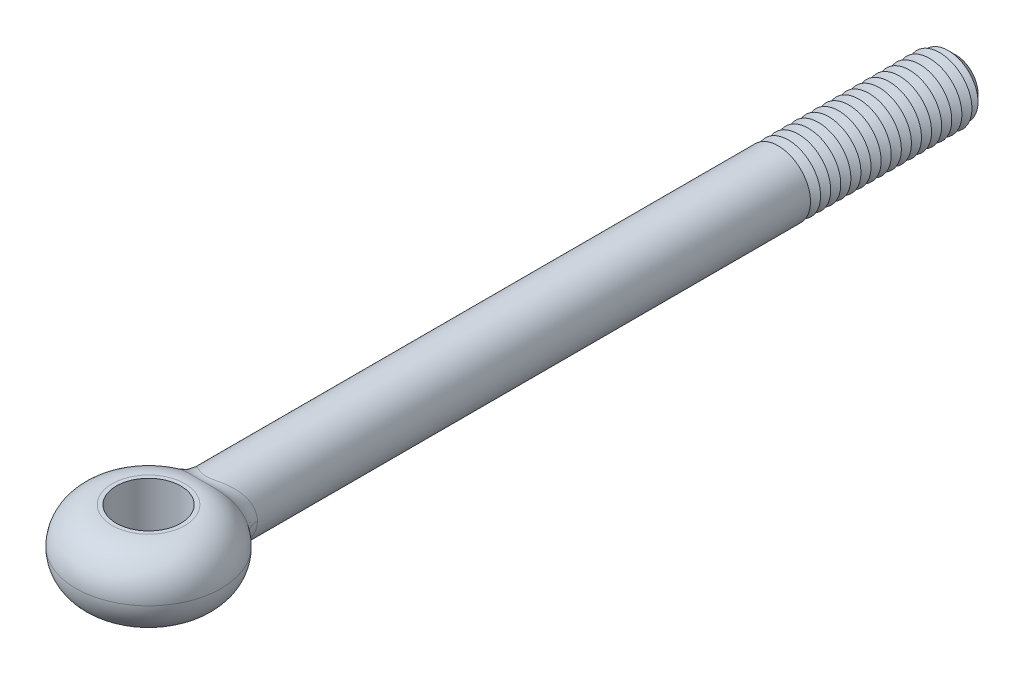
ISO-10303-21;
HEADER;
FILE_DESCRIPTION(('STEP AP214'),'2;1');
FILE_NAME('part.step','',(''),(''),'','','');
FILE_SCHEMA(('AUTOMOTIVE_DESIGN { 1 0 10303 214 1 1 1 1 }'));
ENDSEC;
DATA;
#1=APPLICATION_CONTEXT('core data for automotive mechanical design processes');
#2=APPLICATION_PROTOCOL_DEFINITION('international standard','automotive_design',2000,#1);
#3=PRODUCT_CONTEXT('',#1,'mechanical');
#4=PRODUCT('Part','Part','',(#3));
#5=PRODUCT_RELATED_PRODUCT_CATEGORY('part','',(#4));
#6=PRODUCT_DEFINITION_FORMATION('','',#4);
#7=PRODUCT_DEFINITION_CONTEXT('part definition',#1,'design');
#8=PRODUCT_DEFINITION('design','',#6,#7);
#9=PRODUCT_DEFINITION_SHAPE('','',#8);
#10=(LENGTH_UNIT() NAMED_UNIT(*) SI_UNIT(.MILLI.,.METRE.));
#11=(NAMED_UNIT(*) PLANE_ANGLE_UNIT() SI_UNIT($,.RADIAN.));
#12=(NAMED_UNIT(*) SI_UNIT($,.STERADIAN.) SOLID_ANGLE_UNIT());
#13=UNCERTAINTY_MEASURE_WITH_UNIT(LENGTH_MEASURE(1.E-05),#10,'distance_accuracy_value','');
#14=(GEOMETRIC_REPRESENTATION_CONTEXT(3) GLOBAL_UNCERTAINTY_ASSIGNED_CONTEXT((#13)) GLOBAL_UNIT_ASSIGNED_CONTEXT((#10,
#11,#12)) REPRESENTATION_CONTEXT('',''));
#15=CARTESIAN_POINT('',(0.,0.,0.));
#16=DIRECTION('',(0.,0.,1.));
#17=DIRECTION('',(1.,0.,0.));
#18=AXIS2_PLACEMENT_3D('',#15,#16,#17);
#19=CARTESIAN_POINT('',(0.,0.,-100.));
#20=DIRECTION('',(0.,0.,1.));
#21=DIRECTION('',(1.,0.,0.));
#22=AXIS2_PLACEMENT_3D('',#19,#20,#21);
#23=CYLINDRICAL_SURFACE('',#22,4.);
#24=CARTESIAN_POINT('',(0.,0.,-78.));
#25=DIRECTION('',(0.,0.,-1.));
#26=DIRECTION('',(-1.,0.,0.));
#27=AXIS2_PLACEMENT_3D('',#24,#25,#26);
#28=CIRCLE('',#27,4.);
#29=CARTESIAN_POINT('',(-4.,0.,-78.));
#30=VERTEX_POINT('',#29);
#31=EDGE_CURVE('E80',#30,#30,#28,.T.);
#32=ORIENTED_EDGE('',*,*,#31,.F.);
#33=EDGE_LOOP('',(#32));
#34=FACE_BOUND('',#33,.T.);
#35=CARTESIAN_POINT('',(4.20962840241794,-2.43928241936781,-7.13180336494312));
#36=CARTESIAN_POINT('',(3.41508318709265,-2.1022410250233,-7.85325099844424));
#37=CARTESIAN_POINT('',(3.24770536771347,-2.33503958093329,-8.94098956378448));
#38=CARTESIAN_POINT('',(4.28087481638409,-2.35167865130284,-7.15538303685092));
#39=CARTESIAN_POINT('',(3.46594050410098,-2.01878134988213,-7.88016438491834));
#40=CARTESIAN_POINT('',(3.3080123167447,-2.25117956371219,-8.98524624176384));
#41=CARTESIAN_POINT('',(4.34829202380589,-2.26129214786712,-7.17775809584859));
#42=CARTESIAN_POINT('',(3.51321978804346,-1.934229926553,-7.90531474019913));
#43=CARTESIAN_POINT('',(3.36528002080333,-2.16465573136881,-9.02717355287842));
#44=CARTESIAN_POINT('',(4.47506957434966,-2.07545821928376,-7.21991515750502));
#45=CARTESIAN_POINT('',(3.60104623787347,-1.76294616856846,-7.95222957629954));
#46=CARTESIAN_POINT('',(3.47326653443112,-1.98676342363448,-9.10606640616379));
#47=CARTESIAN_POINT('',(4.53442750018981,-1.98000928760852,-7.23969638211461));
#48=CARTESIAN_POINT('',(3.64154402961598,-1.67624067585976,-7.97396863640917));
#49=CARTESIAN_POINT('',(3.52398337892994,-1.89539350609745,-9.14303045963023));
#50=CARTESIAN_POINT('',(4.64467184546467,-1.78456033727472,-7.27647659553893));
#51=CARTESIAN_POINT('',(3.71589642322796,-1.50113175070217,-8.014023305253));
#52=CARTESIAN_POINT('',(3.61838416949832,-1.70829707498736,-9.21168368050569));
#53=CARTESIAN_POINT('',(4.69555410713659,-1.68455811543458,-7.293474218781));
#54=CARTESIAN_POINT('',(3.74970371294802,-1.41276539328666,-8.0323140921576));
#55=CARTESIAN_POINT('',(3.66206466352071,-1.6125684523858,-9.24337025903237));
#56=CARTESIAN_POINT('',(4.78841066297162,-1.4807377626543,-7.3245150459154));
#57=CARTESIAN_POINT('',(3.81076645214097,-1.23482800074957,-8.06545380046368));
#58=CARTESIAN_POINT('',(3.74191652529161,-1.41745837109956,-9.30118312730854));
#59=CARTESIAN_POINT('',(4.83038616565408,-1.37692015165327,-7.3385586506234));
#60=CARTESIAN_POINT('',(3.8379839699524,-1.1453037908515,-8.0802824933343));
#61=CARTESIAN_POINT('',(3.77808891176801,-1.31807741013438,-9.3273101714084));
#62=CARTESIAN_POINT('',(4.93998011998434,-1.06760765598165,-7.37523749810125));
#63=CARTESIAN_POINT('',(3.90855592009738,-0.880980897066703,-8.11882669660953));
#64=CARTESIAN_POINT('',(3.87264914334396,-1.02198339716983,-9.39550169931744));
#65=CARTESIAN_POINT('',(4.99497846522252,-0.857630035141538,-7.39366200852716));
#66=CARTESIAN_POINT('',(3.94292721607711,-0.705496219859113,-8.13773727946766));
#67=CARTESIAN_POINT('',(3.92027139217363,-0.8209791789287,-9.42968891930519));
#68=CARTESIAN_POINT('',(5.06845478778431,-0.431772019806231,-7.41827830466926));
#69=CARTESIAN_POINT('',(3.98870275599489,-0.353118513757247,-8.16296207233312));
#70=CARTESIAN_POINT('',(3.98393665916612,-0.413320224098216,-9.47534719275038));
#71=CARTESIAN_POINT('',(5.08696110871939,-0.215896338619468,-7.42447958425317));
#72=CARTESIAN_POINT('',(4.00000180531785,-0.176691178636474,-8.16921842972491));
#73=CARTESIAN_POINT('',(4.00000418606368,-0.206669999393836,-9.48683587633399));
#74=CARTESIAN_POINT('',(5.08695185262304,0.2197622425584,-7.42447635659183));
#75=CARTESIAN_POINT('',(3.99999816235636,0.179854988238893,-8.16921612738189));
#76=CARTESIAN_POINT('',(3.99999573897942,0.210370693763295,-9.48683003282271));
#77=CARTESIAN_POINT('',(5.06776741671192,0.439545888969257,-7.41804771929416));
#78=CARTESIAN_POINT('',(3.98828744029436,0.359474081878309,-8.16273153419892));
#79=CARTESIAN_POINT('',(3.98333904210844,0.420761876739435,-9.47492027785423));
#80=CARTESIAN_POINT('',(4.99168987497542,0.872694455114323,-7.39256061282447));
#81=CARTESIAN_POINT('',(3.94086979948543,0.718015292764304,-8.13660527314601));
#82=CARTESIAN_POINT('',(3.91742407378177,0.835399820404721,-9.42764524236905));
#83=CARTESIAN_POINT('',(4.93478135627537,1.08605671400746,-7.37349698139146));
#84=CARTESIAN_POINT('',(3.90528498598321,0.896448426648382,-8.11703072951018));
#85=CARTESIAN_POINT('',(3.86815247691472,1.03964403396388,-9.39227037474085));
#86=CARTESIAN_POINT('',(4.78531683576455,1.49992996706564,-7.32347555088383));
#87=CARTESIAN_POINT('',(3.80902553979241,1.25022198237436,-8.06447660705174));
#88=CARTESIAN_POINT('',(3.73921411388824,1.43583039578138,-9.29926343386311));
#89=CARTESIAN_POINT('',(4.69282180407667,1.70046226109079,-7.29253809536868));
#90=CARTESIAN_POINT('',(3.74864333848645,1.42515573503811,-8.03165463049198));
#91=CARTESIAN_POINT('',(3.65959933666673,1.62779293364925,-9.24166942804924));
#92=CARTESIAN_POINT('',(4.47502076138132,2.08399669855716,-7.2198795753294));
#93=CARTESIAN_POINT('',(3.60161000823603,1.76909189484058,-7.95246604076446));
#94=CARTESIAN_POINT('',(3.47312999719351,1.99493701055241,-9.10603484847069));
#95=CARTESIAN_POINT('',(4.34971613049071,2.26699957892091,-7.17815896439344));
#96=CARTESIAN_POINT('',(3.51529520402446,1.93780912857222,-7.90627607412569));
#97=CARTESIAN_POINT('',(3.36627658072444,2.17011925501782,-9.02799513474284));
#98=CARTESIAN_POINT('',(4.06503409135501,2.61710755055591,-7.08395651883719));
#99=CARTESIAN_POINT('',(3.31258804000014,2.2704191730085,-7.7990178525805));
#100=CARTESIAN_POINT('',(3.12531975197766,2.50526534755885,-8.85118504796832));
#101=CARTESIAN_POINT('',(3.90469024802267,2.78351182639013,-7.03117167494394));
#102=CARTESIAN_POINT('',(3.19569010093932,2.43389360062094,-7.73770595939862));
#103=CARTESIAN_POINT('',(2.99045029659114,2.66455832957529,-8.75182853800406));
#104=CARTESIAN_POINT('',(3.55572279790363,3.09056742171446,-6.91783262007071));
#105=CARTESIAN_POINT('',(2.93333047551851,2.74510282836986,-7.60227773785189));
#106=CARTESIAN_POINT('',(2.70000717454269,2.95849189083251,-8.5376096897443));
#107=CARTESIAN_POINT('',(3.36708914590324,3.23120955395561,-6.85727565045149));
#108=CARTESIAN_POINT('',(2.78824007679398,2.89288136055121,-7.52833413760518));
#109=CARTESIAN_POINT('',(2.54442615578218,3.09312367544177,-8.42274184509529));
#110=CARTESIAN_POINT('',(3.05590482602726,3.42698066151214,-6.7601891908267));
#111=CARTESIAN_POINT('',(2.54246419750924,3.10521527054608,-7.40650692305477));
#112=CARTESIAN_POINT('',(2.29139242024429,3.28052849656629,-8.23777021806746));
#113=CARTESIAN_POINT('',(2.94239191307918,3.49188009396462,-6.72527979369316));
#114=CARTESIAN_POINT('',(2.45203508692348,3.17679613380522,-7.3622733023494));
#115=CARTESIAN_POINT('',(2.19974288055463,3.34265444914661,-8.1711096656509));
#116=CARTESIAN_POINT('',(2.70774871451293,3.61334721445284,-6.65476356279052));
#117=CARTESIAN_POINT('',(2.2631888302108,3.31294369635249,-7.27185687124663));
#118=CARTESIAN_POINT('',(2.01195985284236,3.45893066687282,-8.03614064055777));
#119=CARTESIAN_POINT('',(2.58662025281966,3.66991688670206,-6.61915689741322));
#120=CARTESIAN_POINT('',(2.16480399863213,3.37756025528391,-7.22567879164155));
#121=CARTESIAN_POINT('',(1.91582743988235,3.51308283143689,-7.96783256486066));
#122=CARTESIAN_POINT('',(2.33643912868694,3.7746567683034,-6.5481070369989));
#123=CARTESIAN_POINT('',(1.95995542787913,3.49905860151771,-7.13254784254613));
#124=CARTESIAN_POINT('',(1.71927955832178,3.61334665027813,-7.83121951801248));
#125=CARTESIAN_POINT('',(2.20737584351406,3.82281537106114,-6.51266413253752));
#126=CARTESIAN_POINT('',(1.85349180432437,3.55598889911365,-7.08558378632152));
#127=CARTESIAN_POINT('',(1.61885840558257,3.65944719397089,-7.76291467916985));
#128=CARTESIAN_POINT('',(1.94104355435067,3.91049331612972,-6.44329335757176));
#129=CARTESIAN_POINT('',(1.6325295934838,3.66114192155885,-6.99281685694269));
#130=CARTESIAN_POINT('',(1.41399106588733,3.74337821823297,-7.62894442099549));
#131=CARTESIAN_POINT('',(1.80377767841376,3.9500159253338,-6.40936491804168));
#132=CARTESIAN_POINT('',(1.51802234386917,3.70943392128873,-6.94698677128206));
#133=CARTESIAN_POINT('',(1.3095464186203,3.78121182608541,-7.56327801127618));
#134=CARTESIAN_POINT('',(1.57227788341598,4.0073375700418,-6.35676863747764));
#135=CARTESIAN_POINT('',(1.32409359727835,3.78043323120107,-6.87537018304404));
#136=CARTESIAN_POINT('',(1.13554714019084,3.83608382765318,-7.46130151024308));
#137=CARTESIAN_POINT('',(1.48068953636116,4.02779217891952,-6.33706161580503));
#138=CARTESIAN_POINT('',(1.24725687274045,3.80602263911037,-6.84840856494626));
#139=CARTESIAN_POINT('',(1.0672193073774,3.85566430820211,-7.42304591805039));
#140=CARTESIAN_POINT('',(1.29376653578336,4.06503946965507,-6.29972707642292));
#141=CARTESIAN_POINT('',(1.09023122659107,3.85298164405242,-6.79713154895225));
#142=CARTESIAN_POINT('',(0.928835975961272,3.89131983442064,-7.35050186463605));
#143=CARTESIAN_POINT('',(1.19843101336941,4.08183129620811,-6.28210004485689));
#144=CARTESIAN_POINT('',(1.01002281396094,3.87436823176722,-6.77280179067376));
#145=CARTESIAN_POINT('',(0.858780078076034,3.90739406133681,-7.31621433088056));
#146=CARTESIAN_POINT('',(1.00443416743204,4.11153418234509,-6.24984169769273));
#147=CARTESIAN_POINT('',(0.846704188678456,3.91244466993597,-6.72814466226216));
#148=CARTESIAN_POINT('',(0.717251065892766,3.93582759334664,-7.25341859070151));
#149=CARTESIAN_POINT('',(0.905787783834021,4.12446059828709,-6.23519860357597));
#150=CARTESIAN_POINT('',(0.763580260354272,3.92916988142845,-6.70778483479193));
#151=CARTESIAN_POINT('',(0.645784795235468,3.94820159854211,-7.22488766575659));
#152=CARTESIAN_POINT('',(0.705195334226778,4.14632005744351,-6.20979408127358));
#153=CARTESIAN_POINT('',(0.594535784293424,3.95758629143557,-6.67239577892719));
#154=CARTESIAN_POINT('',(0.5013462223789,3.96912689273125,-7.17536275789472));
#155=CARTESIAN_POINT('',(0.603251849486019,4.15525614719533,-6.19902969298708));
#156=CARTESIAN_POINT('',(0.508579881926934,3.96929598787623,-6.65734565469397));
#157=CARTESIAN_POINT('',(0.428375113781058,3.97768109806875,-7.1543630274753));
#158=CARTESIAN_POINT('',(0.412029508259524,4.16793662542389,-6.18352731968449));
#159=CARTESIAN_POINT('',(0.347370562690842,3.98595413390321,-6.63565356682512));
#160=CARTESIAN_POINT('',(0.292075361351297,3.98981967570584,-7.12411158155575));
#161=CARTESIAN_POINT('',(0.32308798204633,4.17225051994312,-6.17813670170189));
#162=CARTESIAN_POINT('',(0.272375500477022,3.99164885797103,-6.62809397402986));
#163=CARTESIAN_POINT('',(0.228903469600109,3.99394921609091,-7.11358793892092));
#164=CARTESIAN_POINT('',(0.144284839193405,4.17773453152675,-6.17125850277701));
#165=CARTESIAN_POINT('',(0.121644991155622,3.99889046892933,-6.61844960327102));
#166=CARTESIAN_POINT('',(0.102130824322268,3.99919886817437,-7.10015930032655));
#167=CARTESIAN_POINT('',(0.0544233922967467,4.17890521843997,-6.16977021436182));
#168=CARTESIAN_POINT('',(0.0458757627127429,4.00044140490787,-6.61635946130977));
#169=CARTESIAN_POINT('',(0.0385301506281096,4.00031952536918,-7.09725292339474));
#170=CARTESIAN_POINT('',(-0.125189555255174,4.17807377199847,-6.17082052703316));
#171=CARTESIAN_POINT('',(-0.105535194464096,3.9993418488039,-6.61783304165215));
#172=CARTESIAN_POINT('',(-0.0886280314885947,3.99952361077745,-7.09930377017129));
#173=CARTESIAN_POINT('',(-0.214940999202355,4.17607039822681,-6.17336070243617));
#174=CARTESIAN_POINT('',(-0.181212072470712,3.99668920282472,-6.62139966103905));
#175=CARTESIAN_POINT('',(-0.152185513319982,3.9976058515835,-7.1042640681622));
#176=CARTESIAN_POINT('',(-0.393267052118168,4.16893881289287,-6.18226051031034));
#177=CARTESIAN_POINT('',(-0.331541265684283,3.98728173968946,-6.633873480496));
#178=CARTESIAN_POINT('',(-0.278751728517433,3.99077903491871,-7.12163796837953));
#179=CARTESIAN_POINT('',(-0.481841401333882,4.16380992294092,-6.18862097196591));
#180=CARTESIAN_POINT('',(-0.406226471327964,3.98052180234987,-6.64278739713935));
#181=CARTESIAN_POINT('',(-0.341760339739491,3.98586932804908,-7.13405318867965));
#182=CARTESIAN_POINT('',(-0.688095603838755,4.14817563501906,-6.20755254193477));
#183=CARTESIAN_POINT('',(-0.580119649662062,3.96002144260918,-6.66925886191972));
#184=CARTESIAN_POINT('',(-0.48906356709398,3.97090317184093,-7.17098958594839));
#185=CARTESIAN_POINT('',(-0.804946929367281,4.13640802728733,-6.22152677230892));
#186=CARTESIAN_POINT('',(-0.678644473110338,3.9446436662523,-6.68877522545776));
#187=CARTESIAN_POINT('',(-0.57297516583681,3.95963845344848,-7.19824359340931));
#188=CARTESIAN_POINT('',(-1.03394062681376,4.1076481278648,-6.25415363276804));
#189=CARTESIAN_POINT('',(-0.871568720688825,3.90744263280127,-6.73412611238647));
#190=CARTESIAN_POINT('',(-0.73864371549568,3.93210760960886,-7.26181631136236));
#191=CARTESIAN_POINT('',(-1.14608021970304,4.09065280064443,-6.27280897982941));
#192=CARTESIAN_POINT('',(-0.966017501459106,3.88559131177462,-6.75999090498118));
#193=CARTESIAN_POINT('',(-0.820399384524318,3.9158385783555,-7.29814028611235));
#194=CARTESIAN_POINT('',(-1.36592763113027,4.05161532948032,-6.31347216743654));
#195=CARTESIAN_POINT('',(-1.15091612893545,3.83597962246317,-6.81605607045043));
#196=CARTESIAN_POINT('',(-0.982033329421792,3.87846937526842,-7.37722308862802));
#197=CARTESIAN_POINT('',(-1.47361079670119,4.02954864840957,-6.33549612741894));
#198=CARTESIAN_POINT('',(-1.24137763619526,3.80816351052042,-6.84630178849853));
#199=CARTESIAN_POINT('',(-1.06190032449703,3.85734571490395,-7.42001284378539));
#200=CARTESIAN_POINT('',(-1.68409994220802,3.98060721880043,-6.38167314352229));
#201=CARTESIAN_POINT('',(-1.41779320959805,3.74723624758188,-6.90932190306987));
#202=CARTESIAN_POINT('',(-1.21937267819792,3.81049579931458,-7.50960647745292));
#203=CARTESIAN_POINT('',(-1.7869061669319,3.95373271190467,-6.40582609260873));
#204=CARTESIAN_POINT('',(-1.50376847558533,3.71409743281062,-6.94211616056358));
#205=CARTESIAN_POINT('',(-1.29697815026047,3.78476977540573,-7.55641015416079));
#206=CARTESIAN_POINT('',(-2.03557249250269,3.88144037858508,-6.46712101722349));
#207=CARTESIAN_POINT('',(-1.71119137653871,3.62603584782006,-7.02483194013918));
#208=CARTESIAN_POINT('',(-1.48626510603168,3.71556685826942,-7.67500708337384));
#209=CARTESIAN_POINT('',(-2.17875790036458,3.8332690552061,-6.50499609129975));
#210=CARTESIAN_POINT('',(-1.82993325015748,3.568260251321,-7.07544885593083));
#211=CARTESIAN_POINT('',(-1.59667404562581,3.66945413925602,-7.74813538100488));
#212=CARTESIAN_POINT('',(-2.45590601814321,3.72693983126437,-6.58149722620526));
#213=CARTESIAN_POINT('',(-2.05811594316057,3.44332588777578,-7.17652007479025));
#214=CARTESIAN_POINT('',(-1.81273207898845,3.56766889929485,-7.8954804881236));
#215=CARTESIAN_POINT('',(-2.58986577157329,3.66877875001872,-6.62012352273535));
#216=CARTESIAN_POINT('',(-2.16754889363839,3.37608608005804,-7.22699422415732));
#217=CARTESIAN_POINT('',(-1.9183796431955,3.51199333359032,-7.96969763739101));
#218=CARTESIAN_POINT('',(-2.84860171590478,3.5427552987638,-6.69676099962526));
#219=CARTESIAN_POINT('',(-2.37693766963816,3.23337235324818,-7.32592299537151));
#220=CARTESIAN_POINT('',(-2.12436385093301,3.39135549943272,-8.11658331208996));
#221=CARTESIAN_POINT('',(-2.97339489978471,3.47491160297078,-6.73477321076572));
#222=CARTESIAN_POINT('',(-2.4768805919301,3.15784823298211,-7.37438139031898));
#223=CARTESIAN_POINT('',(-2.22471021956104,3.32641110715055,-8.18925451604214));
#224=CARTESIAN_POINT('',(-3.21406230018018,3.32961759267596,-6.80935300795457));
#225=CARTESIAN_POINT('',(-2.6674564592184,2.99941031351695,-7.4682507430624));
#226=CARTESIAN_POINT('',(-2.41977314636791,3.18732624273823,-8.33148796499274));
#227=CARTESIAN_POINT('',(-3.32993337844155,3.2521639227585,-6.84592008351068));
#228=CARTESIAN_POINT('',(-2.75803338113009,2.91644504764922,-7.51364407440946));
#229=CARTESIAN_POINT('',(-2.5144877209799,3.11318255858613,-8.40104911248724));
#230=CARTESIAN_POINT('',(-3.55210969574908,3.08816037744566,-6.91681788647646));
#231=CARTESIAN_POINT('',(-2.92947959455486,2.74434343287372,-7.60050775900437));
#232=CARTESIAN_POINT('',(-2.69730128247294,2.95618771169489,-8.53560605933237));
#233=CARTESIAN_POINT('',(-3.65843710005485,3.00163264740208,-6.95115374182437));
#234=CARTESIAN_POINT('',(-3.01030527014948,2.65519145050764,-7.64195973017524));
#235=CARTESIAN_POINT('',(-2.78541551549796,2.87335774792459,-8.6006123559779));
#236=CARTESIAN_POINT('',(-3.86134707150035,2.81971508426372,-7.01714488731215));
#237=CARTESIAN_POINT('',(-3.16239702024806,2.47150088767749,-7.72058753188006));
#238=CARTESIAN_POINT('',(-2.95448336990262,2.69921443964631,-8.725285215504));
#239=CARTESIAN_POINT('',(-3.95792606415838,2.72432202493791,-7.04879919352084));
#240=CARTESIAN_POINT('',(-3.23358189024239,2.37695238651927,-7.75772562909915));
#241=CARTESIAN_POINT('',(-3.03543436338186,2.6078980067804,-8.78494981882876));
#242=CARTESIAN_POINT('',(-4.14062182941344,2.52529349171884,-7.10894613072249));
#243=CARTESIAN_POINT('',(-3.36627848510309,2.18351039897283,-7.82739060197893));
#244=CARTESIAN_POINT('',(-3.18924486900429,2.41737496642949,-8.89810456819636));
#245=CARTESIAN_POINT('',(-4.22674123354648,2.42166010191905,-7.13743955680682));
#246=CARTESIAN_POINT('',(-3.42771044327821,2.08463231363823,-7.85987815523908));
#247=CARTESIAN_POINT('',(-3.26210641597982,2.31817035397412,-8.95159626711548));
#248=CARTESIAN_POINT('',(-4.38787338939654,2.20680171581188,-7.19089612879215));
#249=CARTESIAN_POINT('',(-3.54098239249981,1.88340090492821,-7.92009157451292));
#250=CARTESIAN_POINT('',(-3.39891556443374,2.11249395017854,-9.05178694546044));
#251=CARTESIAN_POINT('',(-4.46288140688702,2.09557351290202,-7.21585776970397));
#252=CARTESIAN_POINT('',(-3.59273623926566,1.78108328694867,-7.94777357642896));
#253=CARTESIAN_POINT('',(-3.46285936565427,2.00601908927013,-9.0984830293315));
#254=CARTESIAN_POINT('',(-4.59457320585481,1.87716338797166,-7.25975188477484));
#255=CARTESIAN_POINT('',(-3.68233447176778,1.58359654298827,-7.99590902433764));
#256=CARTESIAN_POINT('',(-3.57543701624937,1.7969427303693,-9.18048322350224));
#257=CARTESIAN_POINT('',(-4.65231387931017,1.77057286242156,-7.27902964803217));
#258=CARTESIAN_POINT('',(-3.72098386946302,1.4886580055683,-8.01677413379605));
#259=CARTESIAN_POINT('',(-3.62494279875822,1.69490735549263,-9.21644383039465));
#260=CARTESIAN_POINT('',(-4.75753290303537,1.55269637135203,-7.31418809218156));
#261=CARTESIAN_POINT('',(-3.79061799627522,1.29722505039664,-8.05449646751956));
#262=CARTESIAN_POINT('',(-3.71533333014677,1.48634182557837,-9.28196073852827));
#263=CARTESIAN_POINT('',(-4.80501232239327,1.4414108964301,-7.33006912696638));
#264=CARTESIAN_POINT('',(-3.82155281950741,1.20078670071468,-8.07132717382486));
#265=CARTESIAN_POINT('',(-3.75621897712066,1.37981214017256,-9.31151770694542));
#266=CARTESIAN_POINT('',(-4.88918515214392,1.21522310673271,-7.35823582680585));
#267=CARTESIAN_POINT('',(-3.87588351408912,1.00699635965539,-8.10097036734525));
#268=CARTESIAN_POINT('',(-3.82880765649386,1.16329049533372,-9.36389868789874));
#269=CARTESIAN_POINT('',(-4.92589907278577,1.10032813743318,-7.3705283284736));
#270=CARTESIAN_POINT('',(-3.89925185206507,0.909712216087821,-8.11376793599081));
#271=CARTESIAN_POINT('',(-3.86052814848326,1.05330556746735,-9.38673550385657));
#272=CARTESIAN_POINT('',(-4.98828435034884,0.867715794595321,-7.39142041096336));
#273=CARTESIAN_POINT('',(-3.93869332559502,0.714454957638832,-8.13541291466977));
#274=CARTESIAN_POINT('',(-3.91448130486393,0.830633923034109,-9.42552718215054));
#275=CARTESIAN_POINT('',(-5.01396103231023,0.749999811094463,-7.4000217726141));
#276=CARTESIAN_POINT('',(-3.95473808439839,0.616556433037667,-8.14424484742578));
#277=CARTESIAN_POINT('',(-3.93671854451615,0.717948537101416,-9.4414853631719));
#278=CARTESIAN_POINT('',(-5.05160356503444,0.527069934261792,-7.41263256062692));
#279=CARTESIAN_POINT('',(-3.97817394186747,0.432202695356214,-8.15716098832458));
#280=CARTESIAN_POINT('',(-3.96933623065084,0.504545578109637,-9.46487511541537));
#281=CARTESIAN_POINT('',(-5.06485252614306,0.422066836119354,-7.41707168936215));
#282=CARTESIAN_POINT('',(-3.98636384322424,0.345839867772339,-8.16168301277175));
#283=CARTESIAN_POINT('',(-3.98082580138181,0.404029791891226,-9.47310478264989));
#284=CARTESIAN_POINT('',(-5.08253053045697,0.211392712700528,-7.42299491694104));
#285=CARTESIAN_POINT('',(-3.99727804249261,0.172971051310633,-8.16771217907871));
#286=CARTESIAN_POINT('',(-3.99615939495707,0.202358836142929,-9.48408450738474));
#287=CARTESIAN_POINT('',(-5.0869624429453,0.105721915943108,-7.42447997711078));
#288=CARTESIAN_POINT('',(-3.99999698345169,0.0865213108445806,-8.16921636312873));
#289=CARTESIAN_POINT('',(-4.00000590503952,0.101203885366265,-9.48683634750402));
#290=CARTESIAN_POINT('',(-5.08694423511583,-0.219375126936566,-7.42447385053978));
#291=CARTESIAN_POINT('',(-4.00000625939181,-0.179533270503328,-8.16921920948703));
#292=CARTESIAN_POINT('',(-3.99998774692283,-0.210000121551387,-9.48682599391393));
#293=CARTESIAN_POINT('',(-5.06782392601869,-0.438970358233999,-7.41806690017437));
#294=CARTESIAN_POINT('',(-3.98832493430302,-0.358996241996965,-8.16275208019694));
#295=CARTESIAN_POINT('',(-3.98338811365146,-0.420210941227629,-9.47495588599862));
#296=CARTESIAN_POINT('',(-4.99181098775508,-0.872258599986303,-7.39260093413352));
#297=CARTESIAN_POINT('',(-3.94094286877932,-0.717656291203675,-8.13664564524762));
#298=CARTESIAN_POINT('',(-3.91752889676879,-0.83498259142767,-9.42771999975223));
#299=CARTESIAN_POINT('',(-4.93481503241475,-1.08593379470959,-7.37350730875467));
#300=CARTESIAN_POINT('',(-3.9053086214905,-0.89636142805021,-8.11704297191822));
#301=CARTESIAN_POINT('',(-3.86817997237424,-1.03952636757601,-9.3922899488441));
#302=CARTESIAN_POINT('',(-4.82260503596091,-1.39669226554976,-7.33595529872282));
#303=CARTESIAN_POINT('',(-3.8329428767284,-1.16232084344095,-8.07753492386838));
#304=CARTESIAN_POINT('',(-3.77138225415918,-1.3370045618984,-9.32246736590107));
#305=CARTESIAN_POINT('',(-4.78077456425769,-1.4986077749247,-7.32196123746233));
#306=CARTESIAN_POINT('',(-3.80577950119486,-1.25032878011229,-8.0627417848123));
#307=CARTESIAN_POINT('',(-3.73534257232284,-1.43456470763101,-9.29642949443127));
#308=CARTESIAN_POINT('',(-4.6885140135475,-1.6987113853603,-7.29112215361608));
#309=CARTESIAN_POINT('',(-3.74503190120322,-1.42524573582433,-8.02978510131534));
#310=CARTESIAN_POINT('',(-3.65601915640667,-1.62611688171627,-9.23898630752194));
#311=CARTESIAN_POINT('',(-4.63808284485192,-1.79689901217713,-7.27427676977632));
#312=CARTESIAN_POINT('',(-3.7114841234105,-1.51211059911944,-8.01164097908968));
#313=CARTESIAN_POINT('',(-3.6127345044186,-1.72010845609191,-9.20758031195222));
#314=CARTESIAN_POINT('',(-4.52912947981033,-1.98866953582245,-7.23793066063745));
#315=CARTESIAN_POINT('',(-3.63793253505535,-1.68409419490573,-7.97202907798));
#316=CARTESIAN_POINT('',(-3.51945525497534,-1.90368365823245,-9.13973150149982));
#317=CARTESIAN_POINT('',(-4.47062629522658,-2.08226257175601,-7.21843617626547));
#318=CARTESIAN_POINT('',(-3.59798595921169,-1.76918038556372,-7.95059120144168));
#319=CARTESIAN_POINT('',(-3.46947643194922,-1.99327699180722,-9.10330052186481));
#320=CARTESIAN_POINT('',(-4.34585406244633,-2.2645576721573,-7.17694883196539));
#321=CARTESIAN_POINT('',(-3.51150587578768,-1.93729298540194,-7.90440294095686));
#322=CARTESIAN_POINT('',(-3.36320902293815,-2.16778170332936,-9.02565711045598));
#323=CARTESIAN_POINT('',(-4.27958724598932,-2.3532611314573,-7.15495669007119));
#324=CARTESIAN_POINT('',(-3.46501911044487,-2.02029414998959,-7.87967661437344));
#325=CARTESIAN_POINT('',(-3.30692225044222,-2.2526944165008,-8.98444605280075));
#326=CARTESIAN_POINT('',(-4.20962840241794,-2.43928241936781,-7.13180336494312));
#327=CARTESIAN_POINT('',(-3.41508318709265,-2.1022410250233,-7.85325099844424));
#328=CARTESIAN_POINT('',(-3.24770536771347,-2.33503958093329,-8.94098956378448));
#329=(BOUNDED_SURFACE() B_SPLINE_SURFACE(3,2,((#35,#36,#37),(#38,#39,#40),(#41,#42,#43),(#44,
#45,#46),(#47,#48,#49),(#50,#51,#52),(#53,#54,#55),(#56,#57,#58),(#59,#60,#61),(#62,#63,#64),
(#65,#66,#67),(#68,#69,#70),(#71,#72,#73),(#74,#75,#76),(#77,#78,#79),(#80,#81,#82),(#83,#84,
#85),(#86,#87,#88),(#89,#90,#91),(#92,#93,#94),(#95,#96,#97),(#98,#99,#100),(#101,#102,#103),
(#104,#105,#106),(#107,#108,#109),(#110,#111,#112),(#113,#114,#115),(#116,#117,#118),(#119,#120,
#121),(#122,#123,#124),(#125,#126,#127),(#128,#129,#130),(#131,#132,#133),(#134,#135,#136),
(#137,#138,#139),(#140,#141,#142),(#143,#144,#145),(#146,#147,#148),(#149,#150,#151),(#152,#153,
#154),(#155,#156,#157),(#158,#159,#160),(#161,#162,#163),(#164,#165,#166),(#167,#168,#169),
(#170,#171,#172),(#173,#174,#175),(#176,#177,#178),(#179,#180,#181),(#182,#183,#184),(#185,#186,
#187),(#188,#189,#190),(#191,#192,#193),(#194,#195,#196),(#197,#198,#199),(#200,#201,#202),
(#203,#204,#205),(#206,#207,#208),(#209,#210,#211),(#212,#213,#214),(#215,#216,#217),(#218,#219,
#220),(#221,#222,#223),(#224,#225,#226),(#227,#228,#229),(#230,#231,#232),(#233,#234,#235),
(#236,#237,#238),(#239,#240,#241),(#242,#243,#244),(#245,#246,#247),(#248,#249,#250),(#251,#252,
#253),(#254,#255,#256),(#257,#258,#259),(#260,#261,#262),(#263,#264,#265),(#266,#267,#268),
(#269,#270,#271),(#272,#273,#274),(#275,#276,#277),(#278,#279,#280),(#281,#282,#283),(#284,#285,
#286),(#287,#288,#289),(#290,#291,#292),(#293,#294,#295),(#296,#297,#298),(#299,#300,#301),
(#302,#303,#304),(#305,#306,#307),(#308,#309,#310),(#311,#312,#313),(#314,#315,#316),(#317,#318,
#319),(#320,#321,#322),(#323,#324,#325),(#326,#327,#328)),.UNSPECIFIED.,.F.,.F.,
.F.) B_SPLINE_SURFACE_WITH_KNOTS((4,2,2,2,2,2,2,2,2,2,2,2,2,2,2,2,2,2,2,2,2,2,2,2,2,2,2,2,2,2,2,
2,2,2,2,2,2,2,2,2,2,2,2,2,2,2,2,2,4),(3,3),(0.,0.520645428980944,1.04144667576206,
1.56250265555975,2.08348789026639,3.09060934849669,4.09694825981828,5.12130697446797,
6.14608446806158,7.16911398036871,8.19210046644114,9.2479961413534,10.3042676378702,
10.8793995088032,11.4543941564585,12.0301760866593,12.6057398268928,12.9705703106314,
13.3354858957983,13.6989318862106,14.0620999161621,14.3719634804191,14.6817708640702,
14.9916993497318,15.301695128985,15.7217247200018,16.1419986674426,16.5643505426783,
16.9866811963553,17.6090733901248,18.2316641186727,18.8530699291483,19.4746933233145,
20.0948334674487,20.7152001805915,21.335410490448,21.9558842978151,22.5184424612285,
23.0809419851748,23.6423627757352,24.2035123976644,24.6967605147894,25.1898480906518,
26.2130148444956,27.2389843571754,27.7514948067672,28.2640702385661,28.7754583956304,
29.2866999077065),(0.,1.),
.UNSPECIFIED.) GEOMETRIC_REPRESENTATION_ITEM() RATIONAL_B_SPLINE_SURFACE(((1.,0.911936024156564,
1.),(1.,0.909850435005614,1.),(1.,0.907844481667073,1.),(1.,0.904024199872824,1.),(1.,
0.902209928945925,1.),(1.,0.898805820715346,1.),(1.,0.897216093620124,1.),(1.,0.894291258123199,
1.),(1.,0.892956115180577,1.),(1.,0.889449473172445,1.),(1.,0.887660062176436,1.),(1.,
0.885261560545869,1.),(1.,0.884651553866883,1.),(1.,0.884651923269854,1.),(1.,0.885284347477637,
1.),(1.,0.887767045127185,1.),(1.,0.889617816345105,1.),(1.,0.894396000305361,1.),(1.,
0.897321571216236,1.),(1.,0.904041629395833,1.),(1.,0.907836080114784,1.),(1.,0.91616786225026,
1.),(1.,0.920725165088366,1.),(1.,0.930174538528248,1.),(1.,0.935066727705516,1.),(1.,
0.942600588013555,1.),(1.,0.945252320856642,1.),(1.,0.950486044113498,1.),(1.,0.953068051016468,
1.),(1.,0.958095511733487,1.),(1.,0.960540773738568,1.),(1.,0.965207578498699,1.),(1.,
0.967429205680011,1.),(1.,0.970790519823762,1.),(1.,0.972028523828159,1.),(1.,0.974339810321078,
1.),(1.,0.975413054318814,1.),(1.,0.97735209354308,1.),(1.,0.978218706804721,1.),(1.,
0.979707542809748,1.),(1.,0.980329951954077,1.),(1.,0.981221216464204,1.),(1.,0.981528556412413,
1.),(1.,0.981920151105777,1.),(1.,0.982004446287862,1.),(1.,0.981944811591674,1.),(1.,
0.981800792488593,1.),(1.,0.981293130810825,1.),(1.,0.98092944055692,1.),(1.,0.979837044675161,
1.),(1.,0.979024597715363,1.),(1.,0.977095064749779,1.),(1.,0.975977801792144,1.),(1.,
0.973495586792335,1.),(1.,0.972129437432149,1.),(1.,0.969207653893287,1.),(1.,0.967652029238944,
1.),(1.,0.963624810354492,1.),(1.,0.961068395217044,1.),(1.,0.955756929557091,1.),(1.,
0.95300181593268,1.),(1.,0.947392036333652,1.),(1.,0.94453756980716,1.),(1.,0.938804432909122,
1.),(1.,0.935925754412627,1.),(1.,0.930226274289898,1.),(1.,0.927405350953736,1.),(1.,
0.921882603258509,1.),(1.,0.919180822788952,1.),(1.,0.913963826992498,1.),(1.,0.9114485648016,
1.),(1.,0.906664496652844,1.),(1.,0.904395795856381,1.),(1.,0.900360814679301,1.),(1.,
0.898567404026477,1.),(1.,0.89526897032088,1.),(1.,0.893763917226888,1.),(1.,0.89107726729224,
1.),(1.,0.889895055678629,1.),(1.,0.88787678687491,1.),(1.,0.887040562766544,1.),(1.,
0.885811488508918,1.),(1.,0.88537723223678,1.),(1.,0.884797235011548,1.),(1.,0.884651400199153,
1.),(1.,0.884652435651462,1.),(1.,0.885282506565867,1.),(1.,0.887763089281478,1.),(1.,
0.889616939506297,1.),(1.,0.893203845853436,1.),(1.,0.894533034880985,1.),(1.,0.897436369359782,
1.),(1.,0.899010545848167,1.),(1.,0.902372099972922,1.),(1.,0.904158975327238,1.),(1.,
0.907917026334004,1.),(1.,0.909888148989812,1.),(1.,0.911936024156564,1.))) REPRESENTATION_ITEM('') SURFACE());
#330=CARTESIAN_POINT('',(-3.24770536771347,-2.33503958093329,-8.94098956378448));
#331=CARTESIAN_POINT('',(-3.30692225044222,-2.2526944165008,-8.98444605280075));
#332=CARTESIAN_POINT('',(-3.36320902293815,-2.16778170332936,-9.02565711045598));
#333=CARTESIAN_POINT('',(-3.46947643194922,-1.99327699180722,-9.10330052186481));
#334=CARTESIAN_POINT('',(-3.51945525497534,-1.90368365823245,-9.13973150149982));
#335=CARTESIAN_POINT('',(-3.6127345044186,-1.72010845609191,-9.20758031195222));
#336=CARTESIAN_POINT('',(-3.65601915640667,-1.62611688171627,-9.23898630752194));
#337=CARTESIAN_POINT('',(-3.73534257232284,-1.43456470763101,-9.29642949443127));
#338=CARTESIAN_POINT('',(-3.77138225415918,-1.3370045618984,-9.32246736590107));
#339=CARTESIAN_POINT('',(-3.86817997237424,-1.03952636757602,-9.3922899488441));
#340=CARTESIAN_POINT('',(-3.91752889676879,-0.83498259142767,-9.42771999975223));
#341=CARTESIAN_POINT('',(-3.98338811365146,-0.420210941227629,-9.47495588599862));
#342=CARTESIAN_POINT('',(-3.99998774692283,-0.210000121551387,-9.48682599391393));
#343=CARTESIAN_POINT('',(-4.00000590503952,0.101203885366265,-9.48683634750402));
#344=CARTESIAN_POINT('',(-3.99615939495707,0.202358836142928,-9.48408450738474));
#345=CARTESIAN_POINT('',(-3.98082580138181,0.404029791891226,-9.47310478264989));
#346=CARTESIAN_POINT('',(-3.96933623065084,0.504545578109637,-9.46487511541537));
#347=CARTESIAN_POINT('',(-3.93671854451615,0.717948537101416,-9.4414853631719));
#348=CARTESIAN_POINT('',(-3.91448130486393,0.830633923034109,-9.42552718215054));
#349=CARTESIAN_POINT('',(-3.86052814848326,1.05330556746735,-9.38673550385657));
#350=CARTESIAN_POINT('',(-3.82880765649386,1.16329049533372,-9.36389868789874));
#351=CARTESIAN_POINT('',(-3.75621897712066,1.37981214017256,-9.31151770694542));
#352=CARTESIAN_POINT('',(-3.71533333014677,1.48634182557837,-9.28196073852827));
#353=CARTESIAN_POINT('',(-3.62494279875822,1.69490735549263,-9.21644383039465));
#354=CARTESIAN_POINT('',(-3.57543701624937,1.7969427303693,-9.18048322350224));
#355=CARTESIAN_POINT('',(-3.46285936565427,2.00601908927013,-9.0984830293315));
#356=CARTESIAN_POINT('',(-3.39891556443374,2.11249395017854,-9.05178694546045));
#357=CARTESIAN_POINT('',(-3.26210641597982,2.31817035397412,-8.95159626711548));
#358=CARTESIAN_POINT('',(-3.18924486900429,2.41737496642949,-8.89810456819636));
#359=CARTESIAN_POINT('',(-3.03543436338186,2.6078980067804,-8.78494981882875));
#360=CARTESIAN_POINT('',(-2.95448336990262,2.69921443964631,-8.725285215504));
#361=CARTESIAN_POINT('',(-2.78541551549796,2.87335774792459,-8.6006123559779));
#362=CARTESIAN_POINT('',(-2.69730128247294,2.95618771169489,-8.53560605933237));
#363=CARTESIAN_POINT('',(-2.5144877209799,3.11318255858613,-8.40104911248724));
#364=CARTESIAN_POINT('',(-2.41977314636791,3.18732624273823,-8.33148796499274));
#365=CARTESIAN_POINT('',(-2.22471021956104,3.32641110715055,-8.18925451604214));
#366=CARTESIAN_POINT('',(-2.12436385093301,3.39135549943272,-8.11658331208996));
#367=CARTESIAN_POINT('',(-1.9183796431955,3.51199333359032,-7.96969763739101));
#368=CARTESIAN_POINT('',(-1.81273207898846,3.56766889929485,-7.8954804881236));
#369=CARTESIAN_POINT('',(-1.59667404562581,3.66945413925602,-7.74813538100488));
#370=CARTESIAN_POINT('',(-1.48626510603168,3.71556685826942,-7.67500708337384));
#371=CARTESIAN_POINT('',(-1.29697815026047,3.78476977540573,-7.55641015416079));
#372=CARTESIAN_POINT('',(-1.21937267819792,3.81049579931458,-7.50960647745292));
#373=CARTESIAN_POINT('',(-1.06190032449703,3.85734571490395,-7.42001284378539));
#374=CARTESIAN_POINT('',(-0.982033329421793,3.87846937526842,-7.37722308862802));
#375=CARTESIAN_POINT('',(-0.820399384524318,3.9158385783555,-7.29814028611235));
#376=CARTESIAN_POINT('',(-0.73864371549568,3.93210760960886,-7.26181631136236));
#377=CARTESIAN_POINT('',(-0.572975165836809,3.95963845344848,-7.19824359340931));
#378=CARTESIAN_POINT('',(-0.48906356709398,3.97090317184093,-7.17098958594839));
#379=CARTESIAN_POINT('',(-0.341760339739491,3.98586932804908,-7.13405318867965));
#380=CARTESIAN_POINT('',(-0.278751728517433,3.99077903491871,-7.12163796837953));
#381=CARTESIAN_POINT('',(-0.152185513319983,3.9976058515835,-7.1042640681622));
#382=CARTESIAN_POINT('',(-0.0886280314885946,3.99952361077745,-7.09930377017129));
#383=CARTESIAN_POINT('',(0.0385301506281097,4.00031952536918,-7.09725292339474));
#384=CARTESIAN_POINT('',(0.102130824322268,3.99919886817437,-7.10015930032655));
#385=CARTESIAN_POINT('',(0.228903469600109,3.99394921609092,-7.11358793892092));
#386=CARTESIAN_POINT('',(0.292075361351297,3.98981967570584,-7.12411158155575));
#387=CARTESIAN_POINT('',(0.428375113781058,3.97768109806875,-7.1543630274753));
#388=CARTESIAN_POINT('',(0.5013462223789,3.96912689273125,-7.17536275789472));
#389=CARTESIAN_POINT('',(0.645784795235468,3.94820159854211,-7.22488766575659));
#390=CARTESIAN_POINT('',(0.717251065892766,3.93582759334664,-7.25341859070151));
#391=CARTESIAN_POINT('',(0.858780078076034,3.90739406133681,-7.31621433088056));
#392=CARTESIAN_POINT('',(0.928835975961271,3.89131983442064,-7.35050186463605));
#393=CARTESIAN_POINT('',(1.0672193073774,3.85566430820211,-7.42304591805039));
#394=CARTESIAN_POINT('',(1.13554714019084,3.83608382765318,-7.46130151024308));
#395=CARTESIAN_POINT('',(1.3095464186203,3.78121182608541,-7.56327801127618));
#396=CARTESIAN_POINT('',(1.41399106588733,3.74337821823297,-7.62894442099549));
#397=CARTESIAN_POINT('',(1.61885840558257,3.65944719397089,-7.76291467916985));
#398=CARTESIAN_POINT('',(1.71927955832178,3.61334665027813,-7.83121951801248));
#399=CARTESIAN_POINT('',(1.91582743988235,3.51308283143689,-7.96783256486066));
#400=CARTESIAN_POINT('',(2.01195985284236,3.45893066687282,-8.03614064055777));
#401=CARTESIAN_POINT('',(2.19974288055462,3.34265444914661,-8.1711096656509));
#402=CARTESIAN_POINT('',(2.29139242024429,3.28052849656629,-8.23777021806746));
#403=CARTESIAN_POINT('',(2.54442615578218,3.09312367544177,-8.42274184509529));
#404=CARTESIAN_POINT('',(2.70000717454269,2.95849189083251,-8.5376096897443));
#405=CARTESIAN_POINT('',(2.99045029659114,2.66455832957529,-8.75182853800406));
#406=CARTESIAN_POINT('',(3.12531975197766,2.50526534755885,-8.85118504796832));
#407=CARTESIAN_POINT('',(3.36627658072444,2.17011925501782,-9.02799513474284));
#408=CARTESIAN_POINT('',(3.47312999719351,1.99493701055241,-9.10603484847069));
#409=CARTESIAN_POINT('',(3.65959933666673,1.62779293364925,-9.24166942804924));
#410=CARTESIAN_POINT('',(3.73921411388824,1.43583039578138,-9.29926343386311));
#411=CARTESIAN_POINT('',(3.86815247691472,1.03964403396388,-9.39227037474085));
#412=CARTESIAN_POINT('',(3.91742407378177,0.835399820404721,-9.42764524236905));
#413=CARTESIAN_POINT('',(3.98333904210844,0.420761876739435,-9.47492027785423));
#414=CARTESIAN_POINT('',(3.99999573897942,0.210370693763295,-9.4868300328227));
#415=CARTESIAN_POINT('',(4.00000418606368,-0.206669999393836,-9.48683587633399));
#416=CARTESIAN_POINT('',(3.98393665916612,-0.413320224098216,-9.47534719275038));
#417=CARTESIAN_POINT('',(3.92027139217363,-0.8209791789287,-9.42968891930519));
#418=CARTESIAN_POINT('',(3.87264914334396,-1.02198339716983,-9.39550169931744));
#419=CARTESIAN_POINT('',(3.77808891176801,-1.31807741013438,-9.3273101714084));
#420=CARTESIAN_POINT('',(3.74191652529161,-1.41745837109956,-9.30118312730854));
#421=CARTESIAN_POINT('',(3.66206466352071,-1.6125684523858,-9.24337025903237));
#422=CARTESIAN_POINT('',(3.61838416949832,-1.70829707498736,-9.21168368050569));
#423=CARTESIAN_POINT('',(3.52398337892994,-1.89539350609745,-9.14303045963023));
#424=CARTESIAN_POINT('',(3.47326653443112,-1.98676342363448,-9.10606640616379));
#425=CARTESIAN_POINT('',(3.36528002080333,-2.16465573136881,-9.02717355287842));
#426=CARTESIAN_POINT('',(3.3080123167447,-2.25117956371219,-8.98524624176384));
#427=CARTESIAN_POINT('',(3.24770536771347,-2.33503958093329,-8.94098956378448));
#428=B_SPLINE_CURVE_WITH_KNOTS('',3,(#330,#331,#332,#333,#334,#335,#336,#337,#338,#339,#340,
#341,#342,#343,#344,#345,#346,#347,#348,#349,#350,#351,#352,#353,#354,#355,#356,#357,#358,#359,
#360,#361,#362,#363,#364,#365,#366,#367,#368,#369,#370,#371,#372,#373,#374,#375,#376,#377,#378,
#379,#380,#381,#382,#383,#384,#385,#386,#387,#388,#389,#390,#391,#392,#393,#394,#395,#396,#397,
#398,#399,#400,#401,#402,#403,#404,#405,#406,#407,#408,#409,#410,#411,#412,#413,#414,#415,#416,
#417,#418,#419,#420,#421,#422,#423,#424,#425,#426,#427),.UNSPECIFIED.,.F.,.F.,(4,2,2,2,2,2,2,2,
2,2,2,2,2,2,2,2,2,2,2,2,2,2,2,2,2,2,2,2,2,2,2,2,2,2,2,2,2,2,2,2,2,2,2,2,2,2,2,2,4),(0.,
0.511241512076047,1.02262966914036,1.53520510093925,2.04771555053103,3.07368506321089,
4.09685181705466,4.58993939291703,5.08318751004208,5.64433713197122,6.2057579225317,
6.768257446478,7.33081560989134,7.95128941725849,8.57149972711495,9.19186644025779,
9.81200658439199,10.4336299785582,11.0550357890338,11.6776265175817,12.3000187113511,
12.7223493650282,13.1447012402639,13.5649751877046,13.9850047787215,14.2950005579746,
14.6049290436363,14.9147364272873,15.2245999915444,15.5877680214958,15.9512140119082,
16.3161295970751,16.6809600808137,17.2565238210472,17.8323057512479,18.4073003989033,
18.9824322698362,20.0387037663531,21.0945994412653,22.1175859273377,23.1406154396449,
24.1653929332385,25.1897516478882,26.1960905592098,27.2032120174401,27.7241972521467,
28.2452532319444,28.7660544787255,29.2866999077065),.UNSPECIFIED.);
#429=CARTESIAN_POINT('',(-4.,0.,-9.48683298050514));
#430=VERTEX_POINT('',#429);
#431=CARTESIAN_POINT('',(4.,0.,-9.48683298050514));
#432=VERTEX_POINT('',#431);
#433=EDGE_CURVE('E82',#430,#432,#428,.T.);
#434=ORIENTED_EDGE('',*,*,#433,.T.);
#435=CARTESIAN_POINT('',(-4.20962840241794,2.43928241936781,-7.13180336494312));
#436=CARTESIAN_POINT('',(-3.41508318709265,2.1022410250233,-7.85325099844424));
#437=CARTESIAN_POINT('',(-3.24770536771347,2.33503958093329,-8.94098956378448));
#438=CARTESIAN_POINT('',(-4.28087481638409,2.35167865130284,-7.15538303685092));
#439=CARTESIAN_POINT('',(-3.46594050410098,2.01878134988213,-7.88016438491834));
#440=CARTESIAN_POINT('',(-3.3080123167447,2.25117956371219,-8.98524624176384));
#441=CARTESIAN_POINT('',(-4.34829202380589,2.26129214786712,-7.17775809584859));
#442=CARTESIAN_POINT('',(-3.51321978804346,1.934229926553,-7.90531474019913));
#443=CARTESIAN_POINT('',(-3.36528002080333,2.16465573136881,-9.02717355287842));
#444=CARTESIAN_POINT('',(-4.47506957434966,2.07545821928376,-7.21991515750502));
#445=CARTESIAN_POINT('',(-3.60104623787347,1.76294616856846,-7.95222957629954));
#446=CARTESIAN_POINT('',(-3.47326653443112,1.98676342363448,-9.10606640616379));
#447=CARTESIAN_POINT('',(-4.53442750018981,1.98000928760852,-7.23969638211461));
#448=CARTESIAN_POINT('',(-3.64154402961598,1.67624067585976,-7.97396863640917));
#449=CARTESIAN_POINT('',(-3.52398337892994,1.89539350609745,-9.14303045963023));
#450=CARTESIAN_POINT('',(-4.64467184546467,1.78456033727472,-7.27647659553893));
#451=CARTESIAN_POINT('',(-3.71589642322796,1.50113175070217,-8.014023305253));
#452=CARTESIAN_POINT('',(-3.61838416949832,1.70829707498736,-9.21168368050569));
#453=CARTESIAN_POINT('',(-4.69555410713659,1.68455811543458,-7.293474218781));
#454=CARTESIAN_POINT('',(-3.74970371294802,1.41276539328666,-8.0323140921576));
#455=CARTESIAN_POINT('',(-3.66206466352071,1.6125684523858,-9.24337025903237));
#456=CARTESIAN_POINT('',(-4.78841066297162,1.4807377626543,-7.3245150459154));
#457=CARTESIAN_POINT('',(-3.81076645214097,1.23482800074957,-8.06545380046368));
#458=CARTESIAN_POINT('',(-3.74191652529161,1.41745837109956,-9.30118312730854));
#459=CARTESIAN_POINT('',(-4.83038616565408,1.37692015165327,-7.3385586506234));
#460=CARTESIAN_POINT('',(-3.8379839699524,1.1453037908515,-8.0802824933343));
#461=CARTESIAN_POINT('',(-3.77808891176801,1.31807741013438,-9.3273101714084));
#462=CARTESIAN_POINT('',(-4.93998011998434,1.06760765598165,-7.37523749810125));
#463=CARTESIAN_POINT('',(-3.90855592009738,0.880980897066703,-8.11882669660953));
#464=CARTESIAN_POINT('',(-3.87264914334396,1.02198339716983,-9.39550169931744));
#465=CARTESIAN_POINT('',(-4.99497846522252,0.857630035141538,-7.39366200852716));
#466=CARTESIAN_POINT('',(-3.94292721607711,0.705496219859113,-8.13773727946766));
#467=CARTESIAN_POINT('',(-3.92027139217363,0.8209791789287,-9.42968891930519));
#468=CARTESIAN_POINT('',(-5.06845478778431,0.431772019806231,-7.41827830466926));
#469=CARTESIAN_POINT('',(-3.98870275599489,0.353118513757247,-8.16296207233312));
#470=CARTESIAN_POINT('',(-3.98393665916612,0.413320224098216,-9.47534719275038));
#471=CARTESIAN_POINT('',(-5.08696110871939,0.215896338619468,-7.42447958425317));
#472=CARTESIAN_POINT('',(-4.00000180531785,0.176691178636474,-8.16921842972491));
#473=CARTESIAN_POINT('',(-4.00000418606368,0.206669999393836,-9.48683587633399));
#474=CARTESIAN_POINT('',(-5.08695185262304,-0.2197622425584,-7.42447635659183));
#475=CARTESIAN_POINT('',(-3.99999816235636,-0.179854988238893,-8.16921612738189));
#476=CARTESIAN_POINT('',(-3.99999573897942,-0.210370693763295,-9.48683003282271));
#477=CARTESIAN_POINT('',(-5.06776741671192,-0.439545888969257,-7.41804771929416));
#478=CARTESIAN_POINT('',(-3.98828744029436,-0.359474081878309,-8.16273153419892));
#479=CARTESIAN_POINT('',(-3.98333904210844,-0.420761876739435,-9.47492027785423));
#480=CARTESIAN_POINT('',(-4.99168987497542,-0.872694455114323,-7.39256061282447));
#481=CARTESIAN_POINT('',(-3.94086979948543,-0.718015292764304,-8.13660527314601));
#482=CARTESIAN_POINT('',(-3.91742407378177,-0.835399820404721,-9.42764524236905));
#483=CARTESIAN_POINT('',(-4.93478135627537,-1.08605671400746,-7.37349698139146));
#484=CARTESIAN_POINT('',(-3.90528498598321,-0.896448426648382,-8.11703072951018));
#485=CARTESIAN_POINT('',(-3.86815247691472,-1.03964403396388,-9.39227037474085));
#486=CARTESIAN_POINT('',(-4.78531683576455,-1.49992996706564,-7.32347555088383));
#487=CARTESIAN_POINT('',(-3.80902553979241,-1.25022198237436,-8.06447660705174));
#488=CARTESIAN_POINT('',(-3.73921411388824,-1.43583039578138,-9.29926343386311));
#489=CARTESIAN_POINT('',(-4.69282180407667,-1.70046226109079,-7.29253809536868));
#490=CARTESIAN_POINT('',(-3.74864333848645,-1.42515573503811,-8.03165463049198));
#491=CARTESIAN_POINT('',(-3.65959933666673,-1.62779293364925,-9.24166942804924));
#492=CARTESIAN_POINT('',(-4.47502076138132,-2.08399669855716,-7.2198795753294));
#493=CARTESIAN_POINT('',(-3.60161000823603,-1.76909189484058,-7.95246604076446));
#494=CARTESIAN_POINT('',(-3.47312999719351,-1.99493701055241,-9.10603484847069));
#495=CARTESIAN_POINT('',(-4.34971613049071,-2.26699957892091,-7.17815896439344));
#496=CARTESIAN_POINT('',(-3.51529520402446,-1.93780912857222,-7.90627607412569));
#497=CARTESIAN_POINT('',(-3.36627658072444,-2.17011925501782,-9.02799513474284));
#498=CARTESIAN_POINT('',(-4.06503409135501,-2.61710755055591,-7.08395651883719));
#499=CARTESIAN_POINT('',(-3.31258804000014,-2.2704191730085,-7.7990178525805));
#500=CARTESIAN_POINT('',(-3.12531975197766,-2.50526534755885,-8.85118504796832));
#501=CARTESIAN_POINT('',(-3.90469024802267,-2.78351182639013,-7.03117167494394));
#502=CARTESIAN_POINT('',(-3.19569010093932,-2.43389360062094,-7.73770595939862));
#503=CARTESIAN_POINT('',(-2.99045029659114,-2.66455832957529,-8.75182853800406));
#504=CARTESIAN_POINT('',(-3.55572279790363,-3.09056742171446,-6.91783262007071));
#505=CARTESIAN_POINT('',(-2.93333047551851,-2.74510282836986,-7.60227773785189));
#506=CARTESIAN_POINT('',(-2.70000717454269,-2.95849189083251,-8.5376096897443));
#507=CARTESIAN_POINT('',(-3.36708914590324,-3.23120955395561,-6.85727565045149));
#508=CARTESIAN_POINT('',(-2.78824007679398,-2.89288136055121,-7.52833413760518));
#509=CARTESIAN_POINT('',(-2.54442615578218,-3.09312367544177,-8.42274184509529));
#510=CARTESIAN_POINT('',(-3.05590482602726,-3.42698066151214,-6.7601891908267));
#511=CARTESIAN_POINT('',(-2.54246419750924,-3.10521527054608,-7.40650692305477));
#512=CARTESIAN_POINT('',(-2.29139242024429,-3.28052849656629,-8.23777021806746));
#513=CARTESIAN_POINT('',(-2.94239191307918,-3.49188009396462,-6.72527979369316));
#514=CARTESIAN_POINT('',(-2.45203508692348,-3.17679613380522,-7.3622733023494));
#515=CARTESIAN_POINT('',(-2.19974288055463,-3.34265444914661,-8.1711096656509));
#516=CARTESIAN_POINT('',(-2.70774871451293,-3.61334721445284,-6.65476356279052));
#517=CARTESIAN_POINT('',(-2.2631888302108,-3.31294369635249,-7.27185687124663));
#518=CARTESIAN_POINT('',(-2.01195985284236,-3.45893066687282,-8.03614064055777));
#519=CARTESIAN_POINT('',(-2.58662025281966,-3.66991688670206,-6.61915689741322));
#520=CARTESIAN_POINT('',(-2.16480399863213,-3.37756025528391,-7.22567879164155));
#521=CARTESIAN_POINT('',(-1.91582743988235,-3.51308283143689,-7.96783256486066));
#522=CARTESIAN_POINT('',(-2.33643912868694,-3.7746567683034,-6.5481070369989));
#523=CARTESIAN_POINT('',(-1.95995542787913,-3.49905860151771,-7.13254784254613));
#524=CARTESIAN_POINT('',(-1.71927955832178,-3.61334665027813,-7.83121951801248));
#525=CARTESIAN_POINT('',(-2.20737584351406,-3.82281537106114,-6.51266413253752));
#526=CARTESIAN_POINT('',(-1.85349180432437,-3.55598889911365,-7.08558378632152));
#527=CARTESIAN_POINT('',(-1.61885840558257,-3.65944719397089,-7.76291467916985));
#528=CARTESIAN_POINT('',(-1.94104355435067,-3.91049331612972,-6.44329335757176));
#529=CARTESIAN_POINT('',(-1.6325295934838,-3.66114192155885,-6.99281685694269));
#530=CARTESIAN_POINT('',(-1.41399106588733,-3.74337821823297,-7.62894442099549));
#531=CARTESIAN_POINT('',(-1.80377767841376,-3.9500159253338,-6.40936491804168));
#532=CARTESIAN_POINT('',(-1.51802234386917,-3.70943392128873,-6.94698677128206));
#533=CARTESIAN_POINT('',(-1.3095464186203,-3.78121182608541,-7.56327801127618));
#534=CARTESIAN_POINT('',(-1.57227788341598,-4.0073375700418,-6.35676863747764));
#535=CARTESIAN_POINT('',(-1.32409359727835,-3.78043323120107,-6.87537018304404));
#536=CARTESIAN_POINT('',(-1.13554714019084,-3.83608382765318,-7.46130151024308));
#537=CARTESIAN_POINT('',(-1.48068953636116,-4.02779217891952,-6.33706161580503));
#538=CARTESIAN_POINT('',(-1.24725687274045,-3.80602263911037,-6.84840856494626));
#539=CARTESIAN_POINT('',(-1.0672193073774,-3.85566430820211,-7.42304591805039));
#540=CARTESIAN_POINT('',(-1.29376653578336,-4.06503946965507,-6.29972707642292));
#541=CARTESIAN_POINT('',(-1.09023122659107,-3.85298164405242,-6.79713154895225));
#542=CARTESIAN_POINT('',(-0.928835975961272,-3.89131983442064,-7.35050186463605));
#543=CARTESIAN_POINT('',(-1.19843101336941,-4.08183129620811,-6.28210004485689));
#544=CARTESIAN_POINT('',(-1.01002281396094,-3.87436823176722,-6.77280179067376));
#545=CARTESIAN_POINT('',(-0.858780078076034,-3.90739406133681,-7.31621433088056));
#546=CARTESIAN_POINT('',(-1.00443416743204,-4.11153418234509,-6.24984169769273));
#547=CARTESIAN_POINT('',(-0.846704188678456,-3.91244466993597,-6.72814466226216));
#548=CARTESIAN_POINT('',(-0.717251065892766,-3.93582759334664,-7.25341859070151));
#549=CARTESIAN_POINT('',(-0.905787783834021,-4.12446059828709,-6.23519860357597));
#550=CARTESIAN_POINT('',(-0.763580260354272,-3.92916988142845,-6.70778483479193));
#551=CARTESIAN_POINT('',(-0.645784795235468,-3.94820159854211,-7.22488766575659));
#552=CARTESIAN_POINT('',(-0.705195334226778,-4.14632005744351,-6.20979408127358));
#553=CARTESIAN_POINT('',(-0.594535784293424,-3.95758629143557,-6.67239577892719));
#554=CARTESIAN_POINT('',(-0.5013462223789,-3.96912689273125,-7.17536275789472));
#555=CARTESIAN_POINT('',(-0.603251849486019,-4.15525614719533,-6.19902969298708));
#556=CARTESIAN_POINT('',(-0.508579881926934,-3.96929598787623,-6.65734565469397));
#557=CARTESIAN_POINT('',(-0.428375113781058,-3.97768109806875,-7.1543630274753));
#558=CARTESIAN_POINT('',(-0.412029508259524,-4.16793662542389,-6.18352731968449));
#559=CARTESIAN_POINT('',(-0.347370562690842,-3.98595413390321,-6.63565356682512));
#560=CARTESIAN_POINT('',(-0.292075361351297,-3.98981967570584,-7.12411158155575));
#561=CARTESIAN_POINT('',(-0.32308798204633,-4.17225051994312,-6.17813670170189));
#562=CARTESIAN_POINT('',(-0.272375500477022,-3.99164885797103,-6.62809397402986));
#563=CARTESIAN_POINT('',(-0.228903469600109,-3.99394921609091,-7.11358793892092));
#564=CARTESIAN_POINT('',(-0.144284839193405,-4.17773453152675,-6.17125850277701));
#565=CARTESIAN_POINT('',(-0.121644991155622,-3.99889046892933,-6.61844960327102));
#566=CARTESIAN_POINT('',(-0.102130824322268,-3.99919886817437,-7.10015930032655));
#567=CARTESIAN_POINT('',(-0.0544233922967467,-4.17890521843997,-6.16977021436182));
#568=CARTESIAN_POINT('',(-0.0458757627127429,-4.00044140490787,-6.61635946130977));
#569=CARTESIAN_POINT('',(-0.0385301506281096,-4.00031952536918,-7.09725292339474));
#570=CARTESIAN_POINT('',(0.125189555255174,-4.17807377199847,-6.17082052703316));
#571=CARTESIAN_POINT('',(0.105535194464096,-3.9993418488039,-6.61783304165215));
#572=CARTESIAN_POINT('',(0.0886280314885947,-3.99952361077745,-7.09930377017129));
#573=CARTESIAN_POINT('',(0.214940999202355,-4.17607039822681,-6.17336070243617));
#574=CARTESIAN_POINT('',(0.181212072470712,-3.99668920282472,-6.62139966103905));
#575=CARTESIAN_POINT('',(0.152185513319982,-3.9976058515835,-7.1042640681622));
#576=CARTESIAN_POINT('',(0.393267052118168,-4.16893881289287,-6.18226051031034));
#577=CARTESIAN_POINT('',(0.331541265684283,-3.98728173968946,-6.633873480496));
#578=CARTESIAN_POINT('',(0.278751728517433,-3.99077903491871,-7.12163796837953));
#579=CARTESIAN_POINT('',(0.481841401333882,-4.16380992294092,-6.18862097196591));
#580=CARTESIAN_POINT('',(0.406226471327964,-3.98052180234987,-6.64278739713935));
#581=CARTESIAN_POINT('',(0.341760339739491,-3.98586932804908,-7.13405318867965));
#582=CARTESIAN_POINT('',(0.688095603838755,-4.14817563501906,-6.20755254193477));
#583=CARTESIAN_POINT('',(0.580119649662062,-3.96002144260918,-6.66925886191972));
#584=CARTESIAN_POINT('',(0.48906356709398,-3.97090317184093,-7.17098958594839));
#585=CARTESIAN_POINT('',(0.804946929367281,-4.13640802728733,-6.22152677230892));
#586=CARTESIAN_POINT('',(0.678644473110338,-3.9446436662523,-6.68877522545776));
#587=CARTESIAN_POINT('',(0.57297516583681,-3.95963845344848,-7.19824359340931));
#588=CARTESIAN_POINT('',(1.03394062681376,-4.1076481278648,-6.25415363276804));
#589=CARTESIAN_POINT('',(0.871568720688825,-3.90744263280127,-6.73412611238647));
#590=CARTESIAN_POINT('',(0.73864371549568,-3.93210760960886,-7.26181631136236));
#591=CARTESIAN_POINT('',(1.14608021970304,-4.09065280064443,-6.27280897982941));
#592=CARTESIAN_POINT('',(0.966017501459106,-3.88559131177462,-6.75999090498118));
#593=CARTESIAN_POINT('',(0.820399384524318,-3.9158385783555,-7.29814028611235));
#594=CARTESIAN_POINT('',(1.36592763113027,-4.05161532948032,-6.31347216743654));
#595=CARTESIAN_POINT('',(1.15091612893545,-3.83597962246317,-6.81605607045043));
#596=CARTESIAN_POINT('',(0.982033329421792,-3.87846937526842,-7.37722308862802));
#597=CARTESIAN_POINT('',(1.47361079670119,-4.02954864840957,-6.33549612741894));
#598=CARTESIAN_POINT('',(1.24137763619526,-3.80816351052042,-6.84630178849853));
#599=CARTESIAN_POINT('',(1.06190032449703,-3.85734571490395,-7.42001284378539));
#600=CARTESIAN_POINT('',(1.68409994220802,-3.98060721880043,-6.38167314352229));
#601=CARTESIAN_POINT('',(1.41779320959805,-3.74723624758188,-6.90932190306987));
#602=CARTESIAN_POINT('',(1.21937267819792,-3.81049579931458,-7.50960647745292));
#603=CARTESIAN_POINT('',(1.7869061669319,-3.95373271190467,-6.40582609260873));
#604=CARTESIAN_POINT('',(1.50376847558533,-3.71409743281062,-6.94211616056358));
#605=CARTESIAN_POINT('',(1.29697815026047,-3.78476977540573,-7.55641015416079));
#606=CARTESIAN_POINT('',(2.03557249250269,-3.88144037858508,-6.46712101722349));
#607=CARTESIAN_POINT('',(1.71119137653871,-3.62603584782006,-7.02483194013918));
#608=CARTESIAN_POINT('',(1.48626510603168,-3.71556685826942,-7.67500708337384));
#609=CARTESIAN_POINT('',(2.17875790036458,-3.8332690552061,-6.50499609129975));
#610=CARTESIAN_POINT('',(1.82993325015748,-3.568260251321,-7.07544885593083));
#611=CARTESIAN_POINT('',(1.59667404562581,-3.66945413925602,-7.74813538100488));
#612=CARTESIAN_POINT('',(2.45590601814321,-3.72693983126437,-6.58149722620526));
#613=CARTESIAN_POINT('',(2.05811594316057,-3.44332588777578,-7.17652007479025));
#614=CARTESIAN_POINT('',(1.81273207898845,-3.56766889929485,-7.8954804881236));
#615=CARTESIAN_POINT('',(2.58986577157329,-3.66877875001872,-6.62012352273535));
#616=CARTESIAN_POINT('',(2.16754889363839,-3.37608608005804,-7.22699422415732));
#617=CARTESIAN_POINT('',(1.9183796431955,-3.51199333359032,-7.96969763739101));
#618=CARTESIAN_POINT('',(2.84860171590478,-3.5427552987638,-6.69676099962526));
#619=CARTESIAN_POINT('',(2.37693766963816,-3.23337235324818,-7.32592299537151));
#620=CARTESIAN_POINT('',(2.12436385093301,-3.39135549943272,-8.11658331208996));
#621=CARTESIAN_POINT('',(2.97339489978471,-3.47491160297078,-6.73477321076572));
#622=CARTESIAN_POINT('',(2.4768805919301,-3.15784823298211,-7.37438139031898));
#623=CARTESIAN_POINT('',(2.22471021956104,-3.32641110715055,-8.18925451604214));
#624=CARTESIAN_POINT('',(3.21406230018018,-3.32961759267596,-6.80935300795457));
#625=CARTESIAN_POINT('',(2.6674564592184,-2.99941031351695,-7.4682507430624));
#626=CARTESIAN_POINT('',(2.41977314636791,-3.18732624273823,-8.33148796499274));
#627=CARTESIAN_POINT('',(3.32993337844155,-3.2521639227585,-6.84592008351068));
#628=CARTESIAN_POINT('',(2.75803338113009,-2.91644504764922,-7.51364407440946));
#629=CARTESIAN_POINT('',(2.5144877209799,-3.11318255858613,-8.40104911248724));
#630=CARTESIAN_POINT('',(3.55210969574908,-3.08816037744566,-6.91681788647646));
#631=CARTESIAN_POINT('',(2.92947959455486,-2.74434343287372,-7.60050775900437));
#632=CARTESIAN_POINT('',(2.69730128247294,-2.95618771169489,-8.53560605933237));
#633=CARTESIAN_POINT('',(3.65843710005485,-3.00163264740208,-6.95115374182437));
#634=CARTESIAN_POINT('',(3.01030527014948,-2.65519145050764,-7.64195973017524));
#635=CARTESIAN_POINT('',(2.78541551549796,-2.87335774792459,-8.6006123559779));
#636=CARTESIAN_POINT('',(3.86134707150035,-2.81971508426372,-7.01714488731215));
#637=CARTESIAN_POINT('',(3.16239702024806,-2.47150088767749,-7.72058753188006));
#638=CARTESIAN_POINT('',(2.95448336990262,-2.69921443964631,-8.725285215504));
#639=CARTESIAN_POINT('',(3.95792606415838,-2.72432202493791,-7.04879919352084));
#640=CARTESIAN_POINT('',(3.23358189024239,-2.37695238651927,-7.75772562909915));
#641=CARTESIAN_POINT('',(3.03543436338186,-2.6078980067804,-8.78494981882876));
#642=CARTESIAN_POINT('',(4.14062182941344,-2.52529349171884,-7.10894613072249));
#643=CARTESIAN_POINT('',(3.36627848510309,-2.18351039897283,-7.82739060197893));
#644=CARTESIAN_POINT('',(3.18924486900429,-2.41737496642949,-8.89810456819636));
#645=CARTESIAN_POINT('',(4.22674123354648,-2.42166010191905,-7.13743955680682));
#646=CARTESIAN_POINT('',(3.42771044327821,-2.08463231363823,-7.85987815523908));
#647=CARTESIAN_POINT('',(3.26210641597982,-2.31817035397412,-8.95159626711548));
#648=CARTESIAN_POINT('',(4.38787338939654,-2.20680171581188,-7.19089612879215));
#649=CARTESIAN_POINT('',(3.54098239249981,-1.88340090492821,-7.92009157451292));
#650=CARTESIAN_POINT('',(3.39891556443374,-2.11249395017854,-9.05178694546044));
#651=CARTESIAN_POINT('',(4.46288140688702,-2.09557351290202,-7.21585776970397));
#652=CARTESIAN_POINT('',(3.59273623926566,-1.78108328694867,-7.94777357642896));
#653=CARTESIAN_POINT('',(3.46285936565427,-2.00601908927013,-9.0984830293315));
#654=CARTESIAN_POINT('',(4.59457320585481,-1.87716338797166,-7.25975188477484));
#655=CARTESIAN_POINT('',(3.68233447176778,-1.58359654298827,-7.99590902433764));
#656=CARTESIAN_POINT('',(3.57543701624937,-1.7969427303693,-9.18048322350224));
#657=CARTESIAN_POINT('',(4.65231387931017,-1.77057286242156,-7.27902964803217));
#658=CARTESIAN_POINT('',(3.72098386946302,-1.4886580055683,-8.01677413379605));
#659=CARTESIAN_POINT('',(3.62494279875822,-1.69490735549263,-9.21644383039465));
#660=CARTESIAN_POINT('',(4.75753290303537,-1.55269637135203,-7.31418809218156));
#661=CARTESIAN_POINT('',(3.79061799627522,-1.29722505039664,-8.05449646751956));
#662=CARTESIAN_POINT('',(3.71533333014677,-1.48634182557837,-9.28196073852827));
#663=CARTESIAN_POINT('',(4.80501232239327,-1.4414108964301,-7.33006912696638));
#664=CARTESIAN_POINT('',(3.82155281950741,-1.20078670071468,-8.07132717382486));
#665=CARTESIAN_POINT('',(3.75621897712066,-1.37981214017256,-9.31151770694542));
#666=CARTESIAN_POINT('',(4.88918515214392,-1.21522310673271,-7.35823582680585));
#667=CARTESIAN_POINT('',(3.87588351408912,-1.00699635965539,-8.10097036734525));
#668=CARTESIAN_POINT('',(3.82880765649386,-1.16329049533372,-9.36389868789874));
#669=CARTESIAN_POINT('',(4.92589907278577,-1.10032813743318,-7.3705283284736));
#670=CARTESIAN_POINT('',(3.89925185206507,-0.909712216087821,-8.11376793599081));
#671=CARTESIAN_POINT('',(3.86052814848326,-1.05330556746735,-9.38673550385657));
#672=CARTESIAN_POINT('',(4.98828435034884,-0.867715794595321,-7.39142041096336));
#673=CARTESIAN_POINT('',(3.93869332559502,-0.714454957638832,-8.13541291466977));
#674=CARTESIAN_POINT('',(3.91448130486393,-0.830633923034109,-9.42552718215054));
#675=CARTESIAN_POINT('',(5.01396103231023,-0.749999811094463,-7.4000217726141));
#676=CARTESIAN_POINT('',(3.95473808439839,-0.616556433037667,-8.14424484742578));
#677=CARTESIAN_POINT('',(3.93671854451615,-0.717948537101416,-9.4414853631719));
#678=CARTESIAN_POINT('',(5.05160356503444,-0.527069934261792,-7.41263256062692));
#679=CARTESIAN_POINT('',(3.97817394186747,-0.432202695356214,-8.15716098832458));
#680=CARTESIAN_POINT('',(3.96933623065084,-0.504545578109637,-9.46487511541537));
#681=CARTESIAN_POINT('',(5.06485252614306,-0.422066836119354,-7.41707168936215));
#682=CARTESIAN_POINT('',(3.98636384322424,-0.345839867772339,-8.16168301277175));
#683=CARTESIAN_POINT('',(3.98082580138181,-0.404029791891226,-9.47310478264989));
#684=CARTESIAN_POINT('',(5.08253053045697,-0.211392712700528,-7.42299491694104));
#685=CARTESIAN_POINT('',(3.99727804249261,-0.172971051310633,-8.16771217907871));
#686=CARTESIAN_POINT('',(3.99615939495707,-0.202358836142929,-9.48408450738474));
#687=CARTESIAN_POINT('',(5.0869624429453,-0.105721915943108,-7.42447997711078));
#688=CARTESIAN_POINT('',(3.99999698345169,-0.0865213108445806,-8.16921636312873));
#689=CARTESIAN_POINT('',(4.00000590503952,-0.101203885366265,-9.48683634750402));
#690=CARTESIAN_POINT('',(5.08694423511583,0.219375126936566,-7.42447385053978));
#691=CARTESIAN_POINT('',(4.00000625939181,0.179533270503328,-8.16921920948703));
#692=CARTESIAN_POINT('',(3.99998774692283,0.210000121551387,-9.48682599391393));
#693=CARTESIAN_POINT('',(5.06782392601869,0.438970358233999,-7.41806690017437));
#694=CARTESIAN_POINT('',(3.98832493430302,0.358996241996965,-8.16275208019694));
#695=CARTESIAN_POINT('',(3.98338811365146,0.420210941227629,-9.47495588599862));
#696=CARTESIAN_POINT('',(4.99181098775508,0.872258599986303,-7.39260093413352));
#697=CARTESIAN_POINT('',(3.94094286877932,0.717656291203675,-8.13664564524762));
#698=CARTESIAN_POINT('',(3.91752889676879,0.83498259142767,-9.42771999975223));
#699=CARTESIAN_POINT('',(4.93481503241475,1.08593379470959,-7.37350730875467));
#700=CARTESIAN_POINT('',(3.9053086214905,0.89636142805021,-8.11704297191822));
#701=CARTESIAN_POINT('',(3.86817997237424,1.03952636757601,-9.3922899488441));
#702=CARTESIAN_POINT('',(4.82260503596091,1.39669226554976,-7.33595529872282));
#703=CARTESIAN_POINT('',(3.8329428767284,1.16232084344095,-8.07753492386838));
#704=CARTESIAN_POINT('',(3.77138225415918,1.3370045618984,-9.32246736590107));
#705=CARTESIAN_POINT('',(4.78077456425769,1.4986077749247,-7.32196123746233));
#706=CARTESIAN_POINT('',(3.80577950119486,1.25032878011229,-8.0627417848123));
#707=CARTESIAN_POINT('',(3.73534257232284,1.43456470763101,-9.29642949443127));
#708=CARTESIAN_POINT('',(4.6885140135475,1.6987113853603,-7.29112215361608));
#709=CARTESIAN_POINT('',(3.74503190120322,1.42524573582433,-8.02978510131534));
#710=CARTESIAN_POINT('',(3.65601915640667,1.62611688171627,-9.23898630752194));
#711=CARTESIAN_POINT('',(4.63808284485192,1.79689901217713,-7.27427676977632));
#712=CARTESIAN_POINT('',(3.7114841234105,1.51211059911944,-8.01164097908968));
#713=CARTESIAN_POINT('',(3.6127345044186,1.72010845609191,-9.20758031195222));
#714=CARTESIAN_POINT('',(4.52912947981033,1.98866953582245,-7.23793066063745));
#715=CARTESIAN_POINT('',(3.63793253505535,1.68409419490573,-7.97202907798));
#716=CARTESIAN_POINT('',(3.51945525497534,1.90368365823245,-9.13973150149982));
#717=CARTESIAN_POINT('',(4.47062629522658,2.08226257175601,-7.21843617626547));
#718=CARTESIAN_POINT('',(3.59798595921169,1.76918038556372,-7.95059120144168));
#719=CARTESIAN_POINT('',(3.46947643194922,1.99327699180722,-9.10330052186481));
#720=CARTESIAN_POINT('',(4.34585406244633,2.2645576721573,-7.17694883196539));
#721=CARTESIAN_POINT('',(3.51150587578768,1.93729298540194,-7.90440294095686));
#722=CARTESIAN_POINT('',(3.36320902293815,2.16778170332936,-9.02565711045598));
#723=CARTESIAN_POINT('',(4.27958724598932,2.3532611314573,-7.15495669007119));
#724=CARTESIAN_POINT('',(3.46501911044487,2.02029414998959,-7.87967661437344));
#725=CARTESIAN_POINT('',(3.30692225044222,2.2526944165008,-8.98444605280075));
#726=CARTESIAN_POINT('',(4.20962840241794,2.43928241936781,-7.13180336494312));
#727=CARTESIAN_POINT('',(3.41508318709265,2.1022410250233,-7.85325099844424));
#728=CARTESIAN_POINT('',(3.24770536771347,2.33503958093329,-8.94098956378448));
#729=(BOUNDED_SURFACE() B_SPLINE_SURFACE(3,2,((#435,#436,#437),(#438,#439,#440),(#441,#442,
#443),(#444,#445,#446),(#447,#448,#449),(#450,#451,#452),(#453,#454,#455),(#456,#457,#458),
(#459,#460,#461),(#462,#463,#464),(#465,#466,#467),(#468,#469,#470),(#471,#472,#473),(#474,#475,
#476),(#477,#478,#479),(#480,#481,#482),(#483,#484,#485),(#486,#487,#488),(#489,#490,#491),
(#492,#493,#494),(#495,#496,#497),(#498,#499,#500),(#501,#502,#503),(#504,#505,#506),(#507,#508,
#509),(#510,#511,#512),(#513,#514,#515),(#516,#517,#518),(#519,#520,#521),(#522,#523,#524),
(#525,#526,#527),(#528,#529,#530),(#531,#532,#533),(#534,#535,#536),(#537,#538,#539),(#540,#541,
#542),(#543,#544,#545),(#546,#547,#548),(#549,#550,#551),(#552,#553,#554),(#555,#556,#557),
(#558,#559,#560),(#561,#562,#563),(#564,#565,#566),(#567,#568,#569),(#570,#571,#572),(#573,#574,
#575),(#576,#577,#578),(#579,#580,#581),(#582,#583,#584),(#585,#586,#587),(#588,#589,#590),
(#591,#592,#593),(#594,#595,#596),(#597,#598,#599),(#600,#601,#602),(#603,#604,#605),(#606,#607,
#608),(#609,#610,#611),(#612,#613,#614),(#615,#616,#617),(#618,#619,#620),(#621,#622,#623),
(#624,#625,#626),(#627,#628,#629),(#630,#631,#632),(#633,#634,#635),(#636,#637,#638),(#639,#640,
#641),(#642,#643,#644),(#645,#646,#647),(#648,#649,#650),(#651,#652,#653),(#654,#655,#656),
(#657,#658,#659),(#660,#661,#662),(#663,#664,#665),(#666,#667,#668),(#669,#670,#671),(#672,#673,
#674),(#675,#676,#677),(#678,#679,#680),(#681,#682,#683),(#684,#685,#686),(#687,#688,#689),
(#690,#691,#692),(#693,#694,#695),(#696,#697,#698),(#699,#700,#701),(#702,#703,#704),(#705,#706,
#707),(#708,#709,#710),(#711,#712,#713),(#714,#715,#716),(#717,#718,#719),(#720,#721,#722),
(#723,#724,#725),(#726,#727,#728)),.UNSPECIFIED.,.F.,.F.,.F.) B_SPLINE_SURFACE_WITH_KNOTS((4,2,
2,2,2,2,2,2,2,2,2,2,2,2,2,2,2,2,2,2,2,2,2,2,2,2,2,2,2,2,2,2,2,2,2,2,2,2,2,2,2,2,2,2,2,2,2,2,4),
(3,3),(0.,0.520645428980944,1.04144667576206,1.56250265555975,2.08348789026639,3.09060934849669,
4.09694825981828,5.12130697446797,6.14608446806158,7.16911398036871,8.19210046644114,
9.2479961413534,10.3042676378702,10.8793995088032,11.4543941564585,12.0301760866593,
12.6057398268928,12.9705703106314,13.3354858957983,13.6989318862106,14.0620999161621,
14.3719634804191,14.6817708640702,14.9916993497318,15.301695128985,15.7217247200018,
16.1419986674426,16.5643505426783,16.9866811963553,17.6090733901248,18.2316641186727,
18.8530699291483,19.4746933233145,20.0948334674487,20.7152001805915,21.335410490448,
21.9558842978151,22.5184424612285,23.0809419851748,23.6423627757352,24.2035123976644,
24.6967605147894,25.1898480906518,26.2130148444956,27.2389843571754,27.7514948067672,
28.2640702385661,28.7754583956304,29.2866999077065),(0.,1.),
.UNSPECIFIED.) GEOMETRIC_REPRESENTATION_ITEM() RATIONAL_B_SPLINE_SURFACE(((1.,0.911936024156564,
1.),(1.,0.909850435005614,1.),(1.,0.907844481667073,1.),(1.,0.904024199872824,1.),(1.,
0.902209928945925,1.),(1.,0.898805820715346,1.),(1.,0.897216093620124,1.),(1.,0.894291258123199,
1.),(1.,0.892956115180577,1.),(1.,0.889449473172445,1.),(1.,0.887660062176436,1.),(1.,
0.885261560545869,1.),(1.,0.884651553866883,1.),(1.,0.884651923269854,1.),(1.,0.885284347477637,
1.),(1.,0.887767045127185,1.),(1.,0.889617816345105,1.),(1.,0.894396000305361,1.),(1.,
0.897321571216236,1.),(1.,0.904041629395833,1.),(1.,0.907836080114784,1.),(1.,0.91616786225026,
1.),(1.,0.920725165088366,1.),(1.,0.930174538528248,1.),(1.,0.935066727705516,1.),(1.,
0.942600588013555,1.),(1.,0.945252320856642,1.),(1.,0.950486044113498,1.),(1.,0.953068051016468,
1.),(1.,0.958095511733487,1.),(1.,0.960540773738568,1.),(1.,0.965207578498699,1.),(1.,
0.967429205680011,1.),(1.,0.970790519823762,1.),(1.,0.972028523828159,1.),(1.,0.974339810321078,
1.),(1.,0.975413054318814,1.),(1.,0.97735209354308,1.),(1.,0.978218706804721,1.),(1.,
0.979707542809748,1.),(1.,0.980329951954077,1.),(1.,0.981221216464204,1.),(1.,0.981528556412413,
1.),(1.,0.981920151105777,1.),(1.,0.982004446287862,1.),(1.,0.981944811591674,1.),(1.,
0.981800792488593,1.),(1.,0.981293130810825,1.),(1.,0.98092944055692,1.),(1.,0.979837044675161,
1.),(1.,0.979024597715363,1.),(1.,0.977095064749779,1.),(1.,0.975977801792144,1.),(1.,
0.973495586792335,1.),(1.,0.972129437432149,1.),(1.,0.969207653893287,1.),(1.,0.967652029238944,
1.),(1.,0.963624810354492,1.),(1.,0.961068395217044,1.),(1.,0.955756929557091,1.),(1.,
0.95300181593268,1.),(1.,0.947392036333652,1.),(1.,0.94453756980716,1.),(1.,0.938804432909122,
1.),(1.,0.935925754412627,1.),(1.,0.930226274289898,1.),(1.,0.927405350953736,1.),(1.,
0.921882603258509,1.),(1.,0.919180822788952,1.),(1.,0.913963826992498,1.),(1.,0.9114485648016,
1.),(1.,0.906664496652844,1.),(1.,0.904395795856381,1.),(1.,0.900360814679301,1.),(1.,
0.898567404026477,1.),(1.,0.89526897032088,1.),(1.,0.893763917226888,1.),(1.,0.89107726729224,
1.),(1.,0.889895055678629,1.),(1.,0.88787678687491,1.),(1.,0.887040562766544,1.),(1.,
0.885811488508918,1.),(1.,0.88537723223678,1.),(1.,0.884797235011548,1.),(1.,0.884651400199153,
1.),(1.,0.884652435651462,1.),(1.,0.885282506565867,1.),(1.,0.887763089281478,1.),(1.,
0.889616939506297,1.),(1.,0.893203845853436,1.),(1.,0.894533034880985,1.),(1.,0.897436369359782,
1.),(1.,0.899010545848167,1.),(1.,0.902372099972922,1.),(1.,0.904158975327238,1.),(1.,
0.907917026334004,1.),(1.,0.909888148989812,1.),(1.,0.911936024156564,1.))) REPRESENTATION_ITEM('') SURFACE());
#730=CARTESIAN_POINT('',(3.24770536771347,2.33503958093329,-8.94098956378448));
#731=CARTESIAN_POINT('',(3.30692225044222,2.2526944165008,-8.98444605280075));
#732=CARTESIAN_POINT('',(3.36320902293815,2.16778170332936,-9.02565711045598));
#733=CARTESIAN_POINT('',(3.46947643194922,1.99327699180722,-9.10330052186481));
#734=CARTESIAN_POINT('',(3.51945525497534,1.90368365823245,-9.13973150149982));
#735=CARTESIAN_POINT('',(3.6127345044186,1.72010845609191,-9.20758031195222));
#736=CARTESIAN_POINT('',(3.65601915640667,1.62611688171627,-9.23898630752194));
#737=CARTESIAN_POINT('',(3.73534257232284,1.43456470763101,-9.29642949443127));
#738=CARTESIAN_POINT('',(3.77138225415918,1.3370045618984,-9.32246736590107));
#739=CARTESIAN_POINT('',(3.86817997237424,1.03952636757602,-9.3922899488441));
#740=CARTESIAN_POINT('',(3.91752889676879,0.83498259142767,-9.42771999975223));
#741=CARTESIAN_POINT('',(3.98338811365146,0.420210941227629,-9.47495588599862));
#742=CARTESIAN_POINT('',(3.99998774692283,0.210000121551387,-9.48682599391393));
#743=CARTESIAN_POINT('',(4.00000590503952,-0.101203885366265,-9.48683634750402));
#744=CARTESIAN_POINT('',(3.99615939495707,-0.202358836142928,-9.48408450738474));
#745=CARTESIAN_POINT('',(3.98082580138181,-0.404029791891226,-9.47310478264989));
#746=CARTESIAN_POINT('',(3.96933623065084,-0.504545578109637,-9.46487511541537));
#747=CARTESIAN_POINT('',(3.93671854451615,-0.717948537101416,-9.4414853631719));
#748=CARTESIAN_POINT('',(3.91448130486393,-0.830633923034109,-9.42552718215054));
#749=CARTESIAN_POINT('',(3.86052814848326,-1.05330556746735,-9.38673550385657));
#750=CARTESIAN_POINT('',(3.82880765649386,-1.16329049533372,-9.36389868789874));
#751=CARTESIAN_POINT('',(3.75621897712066,-1.37981214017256,-9.31151770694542));
#752=CARTESIAN_POINT('',(3.71533333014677,-1.48634182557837,-9.28196073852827));
#753=CARTESIAN_POINT('',(3.62494279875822,-1.69490735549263,-9.21644383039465));
#754=CARTESIAN_POINT('',(3.57543701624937,-1.7969427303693,-9.18048322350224));
#755=CARTESIAN_POINT('',(3.46285936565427,-2.00601908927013,-9.0984830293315));
#756=CARTESIAN_POINT('',(3.39891556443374,-2.11249395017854,-9.05178694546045));
#757=CARTESIAN_POINT('',(3.26210641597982,-2.31817035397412,-8.95159626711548));
#758=CARTESIAN_POINT('',(3.18924486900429,-2.41737496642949,-8.89810456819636));
#759=CARTESIAN_POINT('',(3.03543436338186,-2.6078980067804,-8.78494981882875));
#760=CARTESIAN_POINT('',(2.95448336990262,-2.69921443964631,-8.725285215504));
#761=CARTESIAN_POINT('',(2.78541551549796,-2.87335774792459,-8.6006123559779));
#762=CARTESIAN_POINT('',(2.69730128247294,-2.95618771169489,-8.53560605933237));
#763=CARTESIAN_POINT('',(2.5144877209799,-3.11318255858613,-8.40104911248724));
#764=CARTESIAN_POINT('',(2.41977314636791,-3.18732624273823,-8.33148796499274));
#765=CARTESIAN_POINT('',(2.22471021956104,-3.32641110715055,-8.18925451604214));
#766=CARTESIAN_POINT('',(2.12436385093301,-3.39135549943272,-8.11658331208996));
#767=CARTESIAN_POINT('',(1.9183796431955,-3.51199333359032,-7.96969763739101));
#768=CARTESIAN_POINT('',(1.81273207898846,-3.56766889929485,-7.8954804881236));
#769=CARTESIAN_POINT('',(1.59667404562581,-3.66945413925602,-7.74813538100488));
#770=CARTESIAN_POINT('',(1.48626510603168,-3.71556685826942,-7.67500708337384));
#771=CARTESIAN_POINT('',(1.29697815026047,-3.78476977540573,-7.55641015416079));
#772=CARTESIAN_POINT('',(1.21937267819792,-3.81049579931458,-7.50960647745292));
#773=CARTESIAN_POINT('',(1.06190032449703,-3.85734571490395,-7.42001284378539));
#774=CARTESIAN_POINT('',(0.982033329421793,-3.87846937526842,-7.37722308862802));
#775=CARTESIAN_POINT('',(0.820399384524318,-3.9158385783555,-7.29814028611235));
#776=CARTESIAN_POINT('',(0.73864371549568,-3.93210760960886,-7.26181631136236));
#777=CARTESIAN_POINT('',(0.572975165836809,-3.95963845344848,-7.19824359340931));
#778=CARTESIAN_POINT('',(0.48906356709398,-3.97090317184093,-7.17098958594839));
#779=CARTESIAN_POINT('',(0.341760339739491,-3.98586932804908,-7.13405318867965));
#780=CARTESIAN_POINT('',(0.278751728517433,-3.99077903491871,-7.12163796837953));
#781=CARTESIAN_POINT('',(0.152185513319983,-3.9976058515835,-7.1042640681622));
#782=CARTESIAN_POINT('',(0.0886280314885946,-3.99952361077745,-7.09930377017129));
#783=CARTESIAN_POINT('',(-0.0385301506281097,-4.00031952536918,-7.09725292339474));
#784=CARTESIAN_POINT('',(-0.102130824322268,-3.99919886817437,-7.10015930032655));
#785=CARTESIAN_POINT('',(-0.228903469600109,-3.99394921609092,-7.11358793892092));
#786=CARTESIAN_POINT('',(-0.292075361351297,-3.98981967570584,-7.12411158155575));
#787=CARTESIAN_POINT('',(-0.428375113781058,-3.97768109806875,-7.1543630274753));
#788=CARTESIAN_POINT('',(-0.5013462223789,-3.96912689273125,-7.17536275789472));
#789=CARTESIAN_POINT('',(-0.645784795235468,-3.94820159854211,-7.22488766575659));
#790=CARTESIAN_POINT('',(-0.717251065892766,-3.93582759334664,-7.25341859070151));
#791=CARTESIAN_POINT('',(-0.858780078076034,-3.90739406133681,-7.31621433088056));
#792=CARTESIAN_POINT('',(-0.928835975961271,-3.89131983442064,-7.35050186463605));
#793=CARTESIAN_POINT('',(-1.0672193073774,-3.85566430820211,-7.42304591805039));
#794=CARTESIAN_POINT('',(-1.13554714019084,-3.83608382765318,-7.46130151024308));
#795=CARTESIAN_POINT('',(-1.3095464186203,-3.78121182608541,-7.56327801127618));
#796=CARTESIAN_POINT('',(-1.41399106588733,-3.74337821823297,-7.62894442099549));
#797=CARTESIAN_POINT('',(-1.61885840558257,-3.65944719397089,-7.76291467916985));
#798=CARTESIAN_POINT('',(-1.71927955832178,-3.61334665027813,-7.83121951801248));
#799=CARTESIAN_POINT('',(-1.91582743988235,-3.51308283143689,-7.96783256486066));
#800=CARTESIAN_POINT('',(-2.01195985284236,-3.45893066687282,-8.03614064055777));
#801=CARTESIAN_POINT('',(-2.19974288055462,-3.34265444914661,-8.1711096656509));
#802=CARTESIAN_POINT('',(-2.29139242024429,-3.28052849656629,-8.23777021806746));
#803=CARTESIAN_POINT('',(-2.54442615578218,-3.09312367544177,-8.42274184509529));
#804=CARTESIAN_POINT('',(-2.70000717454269,-2.95849189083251,-8.5376096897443));
#805=CARTESIAN_POINT('',(-2.99045029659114,-2.66455832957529,-8.75182853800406));
#806=CARTESIAN_POINT('',(-3.12531975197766,-2.50526534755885,-8.85118504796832));
#807=CARTESIAN_POINT('',(-3.36627658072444,-2.17011925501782,-9.02799513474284));
#808=CARTESIAN_POINT('',(-3.47312999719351,-1.99493701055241,-9.10603484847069));
#809=CARTESIAN_POINT('',(-3.65959933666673,-1.62779293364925,-9.24166942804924));
#810=CARTESIAN_POINT('',(-3.73921411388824,-1.43583039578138,-9.29926343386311));
#811=CARTESIAN_POINT('',(-3.86815247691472,-1.03964403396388,-9.39227037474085));
#812=CARTESIAN_POINT('',(-3.91742407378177,-0.835399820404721,-9.42764524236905));
#813=CARTESIAN_POINT('',(-3.98333904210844,-0.420761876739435,-9.47492027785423));
#814=CARTESIAN_POINT('',(-3.99999573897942,-0.210370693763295,-9.4868300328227));
#815=CARTESIAN_POINT('',(-4.00000418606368,0.206669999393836,-9.48683587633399));
#816=CARTESIAN_POINT('',(-3.98393665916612,0.413320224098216,-9.47534719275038));
#817=CARTESIAN_POINT('',(-3.92027139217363,0.8209791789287,-9.42968891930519));
#818=CARTESIAN_POINT('',(-3.87264914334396,1.02198339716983,-9.39550169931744));
#819=CARTESIAN_POINT('',(-3.77808891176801,1.31807741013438,-9.3273101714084));
#820=CARTESIAN_POINT('',(-3.74191652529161,1.41745837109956,-9.30118312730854));
#821=CARTESIAN_POINT('',(-3.66206466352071,1.6125684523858,-9.24337025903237));
#822=CARTESIAN_POINT('',(-3.61838416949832,1.70829707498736,-9.21168368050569));
#823=CARTESIAN_POINT('',(-3.52398337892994,1.89539350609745,-9.14303045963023));
#824=CARTESIAN_POINT('',(-3.47326653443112,1.98676342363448,-9.10606640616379));
#825=CARTESIAN_POINT('',(-3.36528002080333,2.16465573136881,-9.02717355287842));
#826=CARTESIAN_POINT('',(-3.3080123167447,2.25117956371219,-8.98524624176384));
#827=CARTESIAN_POINT('',(-3.24770536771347,2.33503958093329,-8.94098956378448));
#828=B_SPLINE_CURVE_WITH_KNOTS('',3,(#730,#731,#732,#733,#734,#735,#736,#737,#738,#739,#740,
#741,#742,#743,#744,#745,#746,#747,#748,#749,#750,#751,#752,#753,#754,#755,#756,#757,#758,#759,
#760,#761,#762,#763,#764,#765,#766,#767,#768,#769,#770,#771,#772,#773,#774,#775,#776,#777,#778,
#779,#780,#781,#782,#783,#784,#785,#786,#787,#788,#789,#790,#791,#792,#793,#794,#795,#796,#797,
#798,#799,#800,#801,#802,#803,#804,#805,#806,#807,#808,#809,#810,#811,#812,#813,#814,#815,#816,
#817,#818,#819,#820,#821,#822,#823,#824,#825,#826,#827),.UNSPECIFIED.,.F.,.F.,(4,2,2,2,2,2,2,2,
2,2,2,2,2,2,2,2,2,2,2,2,2,2,2,2,2,2,2,2,2,2,2,2,2,2,2,2,2,2,2,2,2,2,2,2,2,2,2,2,4),(0.,
0.511241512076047,1.02262966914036,1.53520510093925,2.04771555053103,3.07368506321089,
4.09685181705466,4.58993939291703,5.08318751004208,5.64433713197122,6.2057579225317,
6.768257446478,7.33081560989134,7.95128941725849,8.57149972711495,9.19186644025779,
9.81200658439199,10.4336299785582,11.0550357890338,11.6776265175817,12.3000187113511,
12.7223493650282,13.1447012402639,13.5649751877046,13.9850047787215,14.2950005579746,
14.6049290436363,14.9147364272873,15.2245999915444,15.5877680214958,15.9512140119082,
16.3161295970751,16.6809600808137,17.2565238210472,17.8323057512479,18.4073003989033,
18.9824322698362,20.0387037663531,21.0945994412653,22.1175859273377,23.1406154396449,
24.1653929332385,25.1897516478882,26.1960905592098,27.2032120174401,27.7241972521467,
28.2452532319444,28.7660544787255,29.2866999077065),.UNSPECIFIED.);
#829=EDGE_CURVE('E75',#432,#430,#828,.T.);
#830=ORIENTED_EDGE('',*,*,#829,.T.);
#831=EDGE_LOOP('',(#434,#830));
#832=FACE_BOUND('',#831,.T.);
#833=ADVANCED_FACE('F41',(#34,#832),#23,.T.);
#834=CARTESIAN_POINT('',(0.,4.5,0.));
#835=DIRECTION('',(0.,1.,0.));
#836=DIRECTION('',(0.,0.,1.));
#837=AXIS2_PLACEMENT_3D('',#834,#835,#836);
#838=PLANE('',#837);
#839=CARTESIAN_POINT('',(0.,4.5,0.));
#840=DIRECTION('',(0.,1.,0.));
#841=DIRECTION('',(0.,0.,1.));
#842=AXIS2_PLACEMENT_3D('',#839,#840,#841);
#843=CIRCLE('',#842,4.);
#844=CARTESIAN_POINT('',(0.,4.5,4.));
#845=VERTEX_POINT('',#844);
#846=EDGE_CURVE('E178',#845,#845,#843,.T.);
#847=ORIENTED_EDGE('',*,*,#846,.F.);
#848=EDGE_LOOP('',(#847));
#849=FACE_BOUND('',#848,.T.);
#850=CARTESIAN_POINT('',(0.,4.5,0.));
#851=DIRECTION('',(0.,1.,0.));
#852=DIRECTION('',(0.,0.,1.));
#853=AXIS2_PLACEMENT_3D('',#850,#851,#852);
#854=CIRCLE('',#853,4.5);
#855=CARTESIAN_POINT('',(0.,4.5,4.5));
#856=VERTEX_POINT('',#855);
#857=EDGE_CURVE('E86',#856,#856,#854,.T.);
#858=ORIENTED_EDGE('',*,*,#857,.T.);
#859=EDGE_LOOP('',(#858));
#860=FACE_BOUND('',#859,.T.);
#861=ADVANCED_FACE('F116',(#849,#860),#838,.T.);
#862=CARTESIAN_POINT('',(0.,-4.5,0.));
#863=DIRECTION('',(0.,1.,0.));
#864=DIRECTION('',(0.,0.,1.));
#865=AXIS2_PLACEMENT_3D('',#862,#863,#864);
#866=PLANE('',#865);
#867=CARTESIAN_POINT('',(0.,-4.5,0.));
#868=DIRECTION('',(0.,1.,0.));
#869=DIRECTION('',(0.,0.,1.));
#870=AXIS2_PLACEMENT_3D('',#867,#868,#869);
#871=CIRCLE('',#870,4.);
#872=CARTESIAN_POINT('',(0.,-4.5,4.));
#873=VERTEX_POINT('',#872);
#874=EDGE_CURVE('E174',#873,#873,#871,.T.);
#875=ORIENTED_EDGE('',*,*,#874,.T.);
#876=EDGE_LOOP('',(#875));
#877=FACE_BOUND('',#876,.T.);
#878=CARTESIAN_POINT('',(0.,-4.5,0.));
#879=DIRECTION('',(0.,1.,0.));
#880=DIRECTION('',(0.,0.,1.));
#881=AXIS2_PLACEMENT_3D('',#878,#879,#880);
#882=CIRCLE('',#881,4.5);
#883=CARTESIAN_POINT('',(0.,-4.5,4.5));
#884=VERTEX_POINT('',#883);
#885=EDGE_CURVE('E241',#884,#884,#882,.F.);
#886=ORIENTED_EDGE('',*,*,#885,.T.);
#887=EDGE_LOOP('',(#886));
#888=FACE_BOUND('',#887,.T.);
#889=ADVANCED_FACE('F289',(#877,#888),#866,.F.);
#890=CARTESIAN_POINT('',(0.,0.,0.));
#891=DIRECTION('',(0.,1.,0.));
#892=DIRECTION('',(0.,0.,1.));
#893=AXIS2_PLACEMENT_3D('',#890,#891,#892);
#894=DEGENERATE_TOROIDAL_SURFACE('',#893,4.5,4.5,.T.);
#895=ORIENTED_EDGE('',*,*,#857,.F.);
#896=EDGE_LOOP('',(#895));
#897=FACE_BOUND('',#896,.T.);
#898=CARTESIAN_POINT('',(0.,0.,0.));
#899=DIRECTION('',(0.,1.,0.));
#900=DIRECTION('',(0.,0.,1.));
#901=AXIS2_PLACEMENT_3D('',#898,#899,#900);
#902=CIRCLE('',#901,9.);
#903=CARTESIAN_POINT('',(5.08695652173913,0.,-7.42447798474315));
#904=VERTEX_POINT('',#903);
#905=CARTESIAN_POINT('',(-5.08695652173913,0.,-7.42447798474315));
#906=VERTEX_POINT('',#905);
#907=EDGE_CURVE('E153',#904,#906,#902,.F.);
#908=ORIENTED_EDGE('',*,*,#907,.F.);
#909=CARTESIAN_POINT('',(4.20962840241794,-2.43928241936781,-7.13180336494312));
#910=CARTESIAN_POINT('',(4.28087481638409,-2.35167865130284,-7.15538303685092));
#911=CARTESIAN_POINT('',(4.34829202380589,-2.26129214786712,-7.17775809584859));
#912=CARTESIAN_POINT('',(4.47506957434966,-2.07545821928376,-7.21991515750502));
#913=CARTESIAN_POINT('',(4.53442750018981,-1.98000928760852,-7.23969638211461));
#914=CARTESIAN_POINT('',(4.64467184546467,-1.78456033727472,-7.27647659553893));
#915=CARTESIAN_POINT('',(4.69555410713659,-1.68455811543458,-7.293474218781));
#916=CARTESIAN_POINT('',(4.78841066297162,-1.4807377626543,-7.3245150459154));
#917=CARTESIAN_POINT('',(4.83038616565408,-1.37692015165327,-7.3385586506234));
#918=CARTESIAN_POINT('',(4.93998011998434,-1.06760765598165,-7.37523749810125));
#919=CARTESIAN_POINT('',(4.99497846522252,-0.857630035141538,-7.39366200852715));
#920=CARTESIAN_POINT('',(5.06845478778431,-0.431772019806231,-7.41827830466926));
#921=CARTESIAN_POINT('',(5.08696110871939,-0.215896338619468,-7.42447958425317));
#922=CARTESIAN_POINT('',(5.08695185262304,0.2197622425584,-7.42447635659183));
#923=CARTESIAN_POINT('',(5.06776741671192,0.439545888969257,-7.41804771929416));
#924=CARTESIAN_POINT('',(4.99168987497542,0.872694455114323,-7.39256061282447));
#925=CARTESIAN_POINT('',(4.93478135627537,1.08605671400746,-7.37349698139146));
#926=CARTESIAN_POINT('',(4.78531683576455,1.49992996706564,-7.32347555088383));
#927=CARTESIAN_POINT('',(4.69282180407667,1.70046226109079,-7.29253809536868));
#928=CARTESIAN_POINT('',(4.47502076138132,2.08399669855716,-7.2198795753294));
#929=CARTESIAN_POINT('',(4.34971613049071,2.26699957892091,-7.17815896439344));
#930=CARTESIAN_POINT('',(4.06503409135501,2.61710755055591,-7.08395651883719));
#931=CARTESIAN_POINT('',(3.90469024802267,2.78351182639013,-7.03117167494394));
#932=CARTESIAN_POINT('',(3.55572279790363,3.09056742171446,-6.91783262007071));
#933=CARTESIAN_POINT('',(3.36708914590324,3.23120955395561,-6.85727565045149));
#934=CARTESIAN_POINT('',(3.05590482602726,3.42698066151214,-6.7601891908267));
#935=CARTESIAN_POINT('',(2.94239191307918,3.49188009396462,-6.72527979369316));
#936=CARTESIAN_POINT('',(2.70774871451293,3.61334721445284,-6.65476356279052));
#937=CARTESIAN_POINT('',(2.58662025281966,3.66991688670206,-6.61915689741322));
#938=CARTESIAN_POINT('',(2.33643912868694,3.7746567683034,-6.5481070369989));
#939=CARTESIAN_POINT('',(2.20737584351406,3.82281537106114,-6.51266413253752));
#940=CARTESIAN_POINT('',(1.94104355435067,3.91049331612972,-6.44329335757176));
#941=CARTESIAN_POINT('',(1.80377767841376,3.9500159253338,-6.40936491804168));
#942=CARTESIAN_POINT('',(1.57227788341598,4.0073375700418,-6.35676863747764));
#943=CARTESIAN_POINT('',(1.48068953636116,4.02779217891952,-6.33706161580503));
#944=CARTESIAN_POINT('',(1.29376653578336,4.06503946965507,-6.29972707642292));
#945=CARTESIAN_POINT('',(1.19843101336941,4.08183129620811,-6.28210004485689));
#946=CARTESIAN_POINT('',(1.00443416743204,4.11153418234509,-6.24984169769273));
#947=CARTESIAN_POINT('',(0.905787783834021,4.12446059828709,-6.23519860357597));
#948=CARTESIAN_POINT('',(0.705195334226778,4.14632005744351,-6.20979408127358));
#949=CARTESIAN_POINT('',(0.603251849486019,4.15525614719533,-6.19902969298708));
#950=CARTESIAN_POINT('',(0.412029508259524,4.16793662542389,-6.18352731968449));
#951=CARTESIAN_POINT('',(0.32308798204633,4.17225051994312,-6.17813670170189));
#952=CARTESIAN_POINT('',(0.144284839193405,4.17773453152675,-6.17125850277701));
#953=CARTESIAN_POINT('',(0.0544233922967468,4.17890521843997,-6.16977021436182));
#954=CARTESIAN_POINT('',(-0.125189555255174,4.17807377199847,-6.17082052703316));
#955=CARTESIAN_POINT('',(-0.214940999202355,4.17607039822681,-6.17336070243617));
#956=CARTESIAN_POINT('',(-0.393267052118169,4.16893881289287,-6.18226051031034));
#957=CARTESIAN_POINT('',(-0.481841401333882,4.16380992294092,-6.18862097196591));
#958=CARTESIAN_POINT('',(-0.688095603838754,4.14817563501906,-6.20755254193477));
#959=CARTESIAN_POINT('',(-0.80494692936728,4.13640802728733,-6.22152677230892));
#960=CARTESIAN_POINT('',(-1.03394062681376,4.1076481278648,-6.25415363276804));
#961=CARTESIAN_POINT('',(-1.14608021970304,4.09065280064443,-6.27280897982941));
#962=CARTESIAN_POINT('',(-1.36592763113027,4.05161532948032,-6.31347216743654));
#963=CARTESIAN_POINT('',(-1.47361079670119,4.02954864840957,-6.33549612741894));
#964=CARTESIAN_POINT('',(-1.68409994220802,3.98060721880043,-6.38167314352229));
#965=CARTESIAN_POINT('',(-1.7869061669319,3.95373271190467,-6.40582609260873));
#966=CARTESIAN_POINT('',(-2.03557249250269,3.88144037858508,-6.46712101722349));
#967=CARTESIAN_POINT('',(-2.17875790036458,3.8332690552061,-6.50499609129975));
#968=CARTESIAN_POINT('',(-2.45590601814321,3.72693983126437,-6.58149722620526));
#969=CARTESIAN_POINT('',(-2.58986577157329,3.66877875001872,-6.62012352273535));
#970=CARTESIAN_POINT('',(-2.84860171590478,3.5427552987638,-6.69676099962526));
#971=CARTESIAN_POINT('',(-2.97339489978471,3.47491160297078,-6.73477321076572));
#972=CARTESIAN_POINT('',(-3.21406230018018,3.32961759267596,-6.80935300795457));
#973=CARTESIAN_POINT('',(-3.32993337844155,3.2521639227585,-6.84592008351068));
#974=CARTESIAN_POINT('',(-3.55210969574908,3.08816037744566,-6.91681788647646));
#975=CARTESIAN_POINT('',(-3.65843710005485,3.00163264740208,-6.95115374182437));
#976=CARTESIAN_POINT('',(-3.86134707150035,2.81971508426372,-7.01714488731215));
#977=CARTESIAN_POINT('',(-3.95792606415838,2.72432202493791,-7.04879919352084));
#978=CARTESIAN_POINT('',(-4.14062182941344,2.52529349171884,-7.10894613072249));
#979=CARTESIAN_POINT('',(-4.22674123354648,2.42166010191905,-7.13743955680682));
#980=CARTESIAN_POINT('',(-4.38787338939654,2.20680171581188,-7.19089612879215));
#981=CARTESIAN_POINT('',(-4.46288140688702,2.09557351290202,-7.21585776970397));
#982=CARTESIAN_POINT('',(-4.59457320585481,1.87716338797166,-7.25975188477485));
#983=CARTESIAN_POINT('',(-4.65231387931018,1.77057286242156,-7.27902964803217));
#984=CARTESIAN_POINT('',(-4.75753290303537,1.55269637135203,-7.31418809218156));
#985=CARTESIAN_POINT('',(-4.80501232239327,1.4414108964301,-7.33006912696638));
#986=CARTESIAN_POINT('',(-4.88918515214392,1.21522310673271,-7.35823582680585));
#987=CARTESIAN_POINT('',(-4.92589907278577,1.10032813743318,-7.3705283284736));
#988=CARTESIAN_POINT('',(-4.98828435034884,0.867715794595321,-7.39142041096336));
#989=CARTESIAN_POINT('',(-5.01396103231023,0.749999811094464,-7.4000217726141));
#990=CARTESIAN_POINT('',(-5.05160356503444,0.527069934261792,-7.41263256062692));
#991=CARTESIAN_POINT('',(-5.06485252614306,0.422066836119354,-7.41707168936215));
#992=CARTESIAN_POINT('',(-5.08253053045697,0.211392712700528,-7.42299491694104));
#993=CARTESIAN_POINT('',(-5.0869624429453,0.105721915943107,-7.42447997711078));
#994=CARTESIAN_POINT('',(-5.08694423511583,-0.219375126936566,-7.42447385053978));
#995=CARTESIAN_POINT('',(-5.06782392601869,-0.438970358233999,-7.41806690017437));
#996=CARTESIAN_POINT('',(-4.99181098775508,-0.872258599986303,-7.39260093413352));
#997=CARTESIAN_POINT('',(-4.93481503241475,-1.08593379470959,-7.37350730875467));
#998=CARTESIAN_POINT('',(-4.82260503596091,-1.39669226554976,-7.33595529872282));
#999=CARTESIAN_POINT('',(-4.78077456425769,-1.4986077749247,-7.32196123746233));
#1000=CARTESIAN_POINT('',(-4.6885140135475,-1.6987113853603,-7.29112215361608));
#1001=CARTESIAN_POINT('',(-4.63808284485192,-1.79689901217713,-7.27427676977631));
#1002=CARTESIAN_POINT('',(-4.52912947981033,-1.98866953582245,-7.23793066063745));
#1003=CARTESIAN_POINT('',(-4.47062629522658,-2.08226257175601,-7.21843617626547));
#1004=CARTESIAN_POINT('',(-4.34585406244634,-2.2645576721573,-7.17694883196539));
#1005=CARTESIAN_POINT('',(-4.27958724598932,-2.3532611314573,-7.15495669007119));
#1006=CARTESIAN_POINT('',(-4.20962840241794,-2.43928241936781,-7.13180336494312));
#1007=B_SPLINE_CURVE_WITH_KNOTS('',3,(#909,#910,#911,#912,#913,#914,#915,#916,#917,#918,#919,
#920,#921,#922,#923,#924,#925,#926,#927,#928,#929,#930,#931,#932,#933,#934,#935,#936,#937,#938,
#939,#940,#941,#942,#943,#944,#945,#946,#947,#948,#949,#950,#951,#952,#953,#954,#955,#956,#957,
#958,#959,#960,#961,#962,#963,#964,#965,#966,#967,#968,#969,#970,#971,#972,#973,#974,#975,#976,
#977,#978,#979,#980,#981,#982,#983,#984,#985,#986,#987,#988,#989,#990,#991,#992,#993,#994,#995,
#996,#997,#998,#999,#1000,#1001,#1002,#1003,#1004,#1005,#1006),.UNSPECIFIED.,.F.,.F.,(4,2,2,2,2,
2,2,2,2,2,2,2,2,2,2,2,2,2,2,2,2,2,2,2,2,2,2,2,2,2,2,2,2,2,2,2,2,2,2,2,2,2,2,2,2,2,2,2,4),(0.,
0.520645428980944,1.04144667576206,1.56250265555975,2.08348789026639,3.09060934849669,
4.09694825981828,5.12130697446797,6.14608446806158,7.16911398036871,8.19210046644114,
9.2479961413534,10.3042676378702,10.8793995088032,11.4543941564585,12.0301760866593,
12.6057398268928,12.9705703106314,13.3354858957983,13.6989318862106,14.0620999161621,
14.3719634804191,14.6817708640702,14.9916993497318,15.301695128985,15.7217247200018,
16.1419986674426,16.5643505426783,16.9866811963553,17.6090733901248,18.2316641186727,
18.8530699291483,19.4746933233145,20.0948334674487,20.7152001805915,21.335410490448,
21.9558842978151,22.5184424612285,23.0809419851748,23.6423627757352,24.2035123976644,
24.6967605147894,25.1898480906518,26.2130148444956,27.2389843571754,27.7514948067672,
28.2640702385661,28.7754583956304,29.2866999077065),.UNSPECIFIED.);
#1008=EDGE_CURVE('E51',#904,#906,#1007,.T.);
#1009=ORIENTED_EDGE('',*,*,#1008,.T.);
#1010=EDGE_LOOP('',(#908,#1009));
#1011=FACE_BOUND('',#1010,.T.);
#1012=ADVANCED_FACE('F139',(#897,#1011),#894,.T.);
#1013=CARTESIAN_POINT('',(0.,0.,0.));
#1014=DIRECTION('',(0.,1.,0.));
#1015=DIRECTION('',(0.,0.,1.));
#1016=AXIS2_PLACEMENT_3D('',#1013,#1014,#1015);
#1017=DEGENERATE_TOROIDAL_SURFACE('',#1016,4.5,4.5,.T.);
#1018=ORIENTED_EDGE('',*,*,#885,.F.);
#1019=EDGE_LOOP('',(#1018));
#1020=FACE_BOUND('',#1019,.T.);
#1021=ORIENTED_EDGE('',*,*,#907,.T.);
#1022=CARTESIAN_POINT('',(-4.20962840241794,2.43928241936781,-7.13180336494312));
#1023=CARTESIAN_POINT('',(-4.28087481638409,2.35167865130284,-7.15538303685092));
#1024=CARTESIAN_POINT('',(-4.34829202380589,2.26129214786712,-7.17775809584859));
#1025=CARTESIAN_POINT('',(-4.47506957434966,2.07545821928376,-7.21991515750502));
#1026=CARTESIAN_POINT('',(-4.53442750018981,1.98000928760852,-7.23969638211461));
#1027=CARTESIAN_POINT('',(-4.64467184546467,1.78456033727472,-7.27647659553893));
#1028=CARTESIAN_POINT('',(-4.69555410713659,1.68455811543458,-7.293474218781));
#1029=CARTESIAN_POINT('',(-4.78841066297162,1.4807377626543,-7.3245150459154));
#1030=CARTESIAN_POINT('',(-4.83038616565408,1.37692015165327,-7.3385586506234));
#1031=CARTESIAN_POINT('',(-4.93998011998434,1.06760765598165,-7.37523749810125));
#1032=CARTESIAN_POINT('',(-4.99497846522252,0.857630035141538,-7.39366200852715));
#1033=CARTESIAN_POINT('',(-5.06845478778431,0.431772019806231,-7.41827830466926));
#1034=CARTESIAN_POINT('',(-5.08696110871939,0.215896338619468,-7.42447958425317));
#1035=CARTESIAN_POINT('',(-5.08695185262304,-0.2197622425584,-7.42447635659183));
#1036=CARTESIAN_POINT('',(-5.06776741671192,-0.439545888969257,-7.41804771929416));
#1037=CARTESIAN_POINT('',(-4.99168987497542,-0.872694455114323,-7.39256061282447));
#1038=CARTESIAN_POINT('',(-4.93478135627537,-1.08605671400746,-7.37349698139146));
#1039=CARTESIAN_POINT('',(-4.78531683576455,-1.49992996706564,-7.32347555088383));
#1040=CARTESIAN_POINT('',(-4.69282180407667,-1.70046226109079,-7.29253809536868));
#1041=CARTESIAN_POINT('',(-4.47502076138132,-2.08399669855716,-7.2198795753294));
#1042=CARTESIAN_POINT('',(-4.34971613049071,-2.26699957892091,-7.17815896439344));
#1043=CARTESIAN_POINT('',(-4.06503409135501,-2.61710755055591,-7.08395651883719));
#1044=CARTESIAN_POINT('',(-3.90469024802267,-2.78351182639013,-7.03117167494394));
#1045=CARTESIAN_POINT('',(-3.55572279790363,-3.09056742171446,-6.91783262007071));
#1046=CARTESIAN_POINT('',(-3.36708914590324,-3.23120955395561,-6.85727565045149));
#1047=CARTESIAN_POINT('',(-3.05590482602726,-3.42698066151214,-6.7601891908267));
#1048=CARTESIAN_POINT('',(-2.94239191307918,-3.49188009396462,-6.72527979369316));
#1049=CARTESIAN_POINT('',(-2.70774871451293,-3.61334721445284,-6.65476356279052));
#1050=CARTESIAN_POINT('',(-2.58662025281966,-3.66991688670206,-6.61915689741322));
#1051=CARTESIAN_POINT('',(-2.33643912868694,-3.7746567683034,-6.5481070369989));
#1052=CARTESIAN_POINT('',(-2.20737584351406,-3.82281537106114,-6.51266413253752));
#1053=CARTESIAN_POINT('',(-1.94104355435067,-3.91049331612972,-6.44329335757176));
#1054=CARTESIAN_POINT('',(-1.80377767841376,-3.9500159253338,-6.40936491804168));
#1055=CARTESIAN_POINT('',(-1.57227788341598,-4.0073375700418,-6.35676863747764));
#1056=CARTESIAN_POINT('',(-1.48068953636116,-4.02779217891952,-6.33706161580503));
#1057=CARTESIAN_POINT('',(-1.29376653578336,-4.06503946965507,-6.29972707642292));
#1058=CARTESIAN_POINT('',(-1.19843101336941,-4.08183129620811,-6.28210004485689));
#1059=CARTESIAN_POINT('',(-1.00443416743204,-4.11153418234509,-6.24984169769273));
#1060=CARTESIAN_POINT('',(-0.905787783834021,-4.12446059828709,-6.23519860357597));
#1061=CARTESIAN_POINT('',(-0.705195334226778,-4.14632005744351,-6.20979408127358));
#1062=CARTESIAN_POINT('',(-0.603251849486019,-4.15525614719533,-6.19902969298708));
#1063=CARTESIAN_POINT('',(-0.412029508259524,-4.16793662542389,-6.18352731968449));
#1064=CARTESIAN_POINT('',(-0.32308798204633,-4.17225051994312,-6.17813670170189));
#1065=CARTESIAN_POINT('',(-0.144284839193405,-4.17773453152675,-6.17125850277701));
#1066=CARTESIAN_POINT('',(-0.0544233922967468,-4.17890521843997,-6.16977021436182));
#1067=CARTESIAN_POINT('',(0.125189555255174,-4.17807377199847,-6.17082052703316));
#1068=CARTESIAN_POINT('',(0.214940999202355,-4.17607039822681,-6.17336070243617));
#1069=CARTESIAN_POINT('',(0.393267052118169,-4.16893881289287,-6.18226051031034));
#1070=CARTESIAN_POINT('',(0.481841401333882,-4.16380992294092,-6.18862097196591));
#1071=CARTESIAN_POINT('',(0.688095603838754,-4.14817563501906,-6.20755254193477));
#1072=CARTESIAN_POINT('',(0.80494692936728,-4.13640802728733,-6.22152677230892));
#1073=CARTESIAN_POINT('',(1.03394062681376,-4.1076481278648,-6.25415363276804));
#1074=CARTESIAN_POINT('',(1.14608021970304,-4.09065280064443,-6.27280897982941));
#1075=CARTESIAN_POINT('',(1.36592763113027,-4.05161532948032,-6.31347216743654));
#1076=CARTESIAN_POINT('',(1.47361079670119,-4.02954864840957,-6.33549612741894));
#1077=CARTESIAN_POINT('',(1.68409994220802,-3.98060721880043,-6.38167314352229));
#1078=CARTESIAN_POINT('',(1.7869061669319,-3.95373271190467,-6.40582609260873));
#1079=CARTESIAN_POINT('',(2.03557249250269,-3.88144037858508,-6.46712101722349));
#1080=CARTESIAN_POINT('',(2.17875790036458,-3.8332690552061,-6.50499609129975));
#1081=CARTESIAN_POINT('',(2.45590601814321,-3.72693983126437,-6.58149722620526));
#1082=CARTESIAN_POINT('',(2.58986577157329,-3.66877875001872,-6.62012352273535));
#1083=CARTESIAN_POINT('',(2.84860171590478,-3.5427552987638,-6.69676099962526));
#1084=CARTESIAN_POINT('',(2.97339489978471,-3.47491160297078,-6.73477321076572));
#1085=CARTESIAN_POINT('',(3.21406230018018,-3.32961759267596,-6.80935300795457));
#1086=CARTESIAN_POINT('',(3.32993337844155,-3.2521639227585,-6.84592008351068));
#1087=CARTESIAN_POINT('',(3.55210969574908,-3.08816037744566,-6.91681788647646));
#1088=CARTESIAN_POINT('',(3.65843710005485,-3.00163264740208,-6.95115374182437));
#1089=CARTESIAN_POINT('',(3.86134707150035,-2.81971508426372,-7.01714488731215));
#1090=CARTESIAN_POINT('',(3.95792606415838,-2.72432202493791,-7.04879919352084));
#1091=CARTESIAN_POINT('',(4.14062182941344,-2.52529349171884,-7.10894613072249));
#1092=CARTESIAN_POINT('',(4.22674123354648,-2.42166010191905,-7.13743955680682));
#1093=CARTESIAN_POINT('',(4.38787338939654,-2.20680171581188,-7.19089612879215));
#1094=CARTESIAN_POINT('',(4.46288140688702,-2.09557351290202,-7.21585776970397));
#1095=CARTESIAN_POINT('',(4.59457320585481,-1.87716338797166,-7.25975188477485));
#1096=CARTESIAN_POINT('',(4.65231387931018,-1.77057286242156,-7.27902964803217));
#1097=CARTESIAN_POINT('',(4.75753290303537,-1.55269637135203,-7.31418809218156));
#1098=CARTESIAN_POINT('',(4.80501232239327,-1.4414108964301,-7.33006912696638));
#1099=CARTESIAN_POINT('',(4.88918515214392,-1.21522310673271,-7.35823582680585));
#1100=CARTESIAN_POINT('',(4.92589907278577,-1.10032813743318,-7.3705283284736));
#1101=CARTESIAN_POINT('',(4.98828435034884,-0.867715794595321,-7.39142041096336));
#1102=CARTESIAN_POINT('',(5.01396103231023,-0.749999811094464,-7.4000217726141));
#1103=CARTESIAN_POINT('',(5.05160356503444,-0.527069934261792,-7.41263256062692));
#1104=CARTESIAN_POINT('',(5.06485252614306,-0.422066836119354,-7.41707168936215));
#1105=CARTESIAN_POINT('',(5.08253053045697,-0.211392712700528,-7.42299491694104));
#1106=CARTESIAN_POINT('',(5.0869624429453,-0.105721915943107,-7.42447997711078));
#1107=CARTESIAN_POINT('',(5.08694423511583,0.219375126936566,-7.42447385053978));
#1108=CARTESIAN_POINT('',(5.06782392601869,0.438970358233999,-7.41806690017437));
#1109=CARTESIAN_POINT('',(4.99181098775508,0.872258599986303,-7.39260093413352));
#1110=CARTESIAN_POINT('',(4.93481503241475,1.08593379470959,-7.37350730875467));
#1111=CARTESIAN_POINT('',(4.82260503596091,1.39669226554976,-7.33595529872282));
#1112=CARTESIAN_POINT('',(4.78077456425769,1.4986077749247,-7.32196123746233));
#1113=CARTESIAN_POINT('',(4.6885140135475,1.6987113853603,-7.29112215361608));
#1114=CARTESIAN_POINT('',(4.63808284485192,1.79689901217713,-7.27427676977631));
#1115=CARTESIAN_POINT('',(4.52912947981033,1.98866953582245,-7.23793066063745));
#1116=CARTESIAN_POINT('',(4.47062629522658,2.08226257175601,-7.21843617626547));
#1117=CARTESIAN_POINT('',(4.34585406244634,2.2645576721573,-7.17694883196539));
#1118=CARTESIAN_POINT('',(4.27958724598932,2.3532611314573,-7.15495669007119));
#1119=CARTESIAN_POINT('',(4.20962840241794,2.43928241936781,-7.13180336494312));
#1120=B_SPLINE_CURVE_WITH_KNOTS('',3,(#1022,#1023,#1024,#1025,#1026,#1027,#1028,#1029,#1030,
#1031,#1032,#1033,#1034,#1035,#1036,#1037,#1038,#1039,#1040,#1041,#1042,#1043,#1044,#1045,#1046,
#1047,#1048,#1049,#1050,#1051,#1052,#1053,#1054,#1055,#1056,#1057,#1058,#1059,#1060,#1061,#1062,
#1063,#1064,#1065,#1066,#1067,#1068,#1069,#1070,#1071,#1072,#1073,#1074,#1075,#1076,#1077,#1078,
#1079,#1080,#1081,#1082,#1083,#1084,#1085,#1086,#1087,#1088,#1089,#1090,#1091,#1092,#1093,#1094,
#1095,#1096,#1097,#1098,#1099,#1100,#1101,#1102,#1103,#1104,#1105,#1106,#1107,#1108,#1109,#1110,
#1111,#1112,#1113,#1114,#1115,#1116,#1117,#1118,#1119),.UNSPECIFIED.,.F.,.F.,(4,2,2,2,2,2,2,2,2,
2,2,2,2,2,2,2,2,2,2,2,2,2,2,2,2,2,2,2,2,2,2,2,2,2,2,2,2,2,2,2,2,2,2,2,2,2,2,2,4),(0.,
0.520645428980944,1.04144667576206,1.56250265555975,2.08348789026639,3.09060934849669,
4.09694825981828,5.12130697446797,6.14608446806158,7.16911398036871,8.19210046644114,
9.2479961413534,10.3042676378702,10.8793995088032,11.4543941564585,12.0301760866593,
12.6057398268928,12.9705703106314,13.3354858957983,13.6989318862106,14.0620999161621,
14.3719634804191,14.6817708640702,14.9916993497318,15.301695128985,15.7217247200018,
16.1419986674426,16.5643505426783,16.9866811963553,17.6090733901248,18.2316641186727,
18.8530699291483,19.4746933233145,20.0948334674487,20.7152001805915,21.335410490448,
21.9558842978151,22.5184424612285,23.0809419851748,23.6423627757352,24.2035123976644,
24.6967605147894,25.1898480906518,26.2130148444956,27.2389843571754,27.7514948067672,
28.2640702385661,28.7754583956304,29.2866999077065),.UNSPECIFIED.);
#1121=EDGE_CURVE('E77',#906,#904,#1120,.T.);
#1122=ORIENTED_EDGE('',*,*,#1121,.T.);
#1123=EDGE_LOOP('',(#1021,#1122));
#1124=FACE_BOUND('',#1123,.T.);
#1125=ADVANCED_FACE('F135',(#1020,#1124),#1017,.T.);
#1126=CARTESIAN_POINT('',(-6.5,0.,-9.48683298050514));
#1127=DIRECTION('',(0.,1.,0.));
#1128=DIRECTION('',(0.,0.,1.));
#1129=AXIS2_PLACEMENT_3D('',#1126,#1127,#1128);
#1130=CIRCLE('',#1129,2.5);
#1131=EDGE_CURVE('E71',#906,#430,#1130,.T.);
#1132=ORIENTED_EDGE('',*,*,#1131,.F.);
#1133=ORIENTED_EDGE('',*,*,#1008,.F.);
#1134=CARTESIAN_POINT('',(6.5,0.,-9.48683298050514));
#1135=DIRECTION('',(0.,1.,0.));
#1136=DIRECTION('',(0.,0.,1.));
#1137=AXIS2_PLACEMENT_3D('',#1134,#1135,#1136);
#1138=CIRCLE('',#1137,2.5);
#1139=EDGE_CURVE('E64',#432,#904,#1138,.T.);
#1140=ORIENTED_EDGE('',*,*,#1139,.F.);
#1141=ORIENTED_EDGE('',*,*,#433,.F.);
#1142=EDGE_LOOP('',(#1132,#1133,#1140,#1141));
#1143=FACE_BOUND('',#1142,.T.);
#1144=ADVANCED_FACE('F83',(#1143),#329,.F.);
#1145=ORIENTED_EDGE('',*,*,#1139,.T.);
#1146=ORIENTED_EDGE('',*,*,#1121,.F.);
#1147=ORIENTED_EDGE('',*,*,#1131,.T.);
#1148=ORIENTED_EDGE('',*,*,#829,.F.);
#1149=EDGE_LOOP('',(#1145,#1146,#1147,#1148));
#1150=FACE_BOUND('',#1149,.T.);
#1151=ADVANCED_FACE('F73',(#1150),#729,.F.);
#1152=CARTESIAN_POINT('',(0.,0.,-78.));
#1153=DIRECTION('',(0.,0.,1.));
#1154=DIRECTION('',(1.,0.,0.));
#1155=AXIS2_PLACEMENT_3D('',#1152,#1153,#1154);
#1156=CONICAL_SURFACE('',#1155,4.,1.04719755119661);
#1157=CARTESIAN_POINT('',(0.,0.,-78.625));
#1158=DIRECTION('',(0.,0.,-1.));
#1159=DIRECTION('',(-1.,0.,0.));
#1160=AXIS2_PLACEMENT_3D('',#1157,#1158,#1159);
#1161=CIRCLE('',#1160,2.91746824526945);
#1162=CARTESIAN_POINT('',(-2.91746824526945,0.,-78.625));
#1163=VERTEX_POINT('',#1162);
#1164=EDGE_CURVE('E166',#1163,#1163,#1161,.T.);
#1165=ORIENTED_EDGE('',*,*,#1164,.F.);
#1166=EDGE_LOOP('',(#1165));
#1167=FACE_BOUND('',#1166,.T.);
#1168=ORIENTED_EDGE('',*,*,#31,.T.);
#1169=EDGE_LOOP('',(#1168));
#1170=FACE_BOUND('',#1169,.T.);
#1171=ADVANCED_FACE('F385',(#1167,#1170),#1156,.T.);
#1172=CARTESIAN_POINT('',(0.,0.,-78.625));
#1173=DIRECTION('',(0.,0.,-1.));
#1174=DIRECTION('',(-1.,0.,0.));
#1175=AXIS2_PLACEMENT_3D('',#1172,#1173,#1174);
#1176=CONICAL_SURFACE('',#1175,2.91746824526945,1.04719755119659);
#1177=CARTESIAN_POINT('',(0.,0.,-79.25));
#1178=DIRECTION('',(0.,0.,-1.));
#1179=DIRECTION('',(-1.,0.,0.));
#1180=AXIS2_PLACEMENT_3D('',#1177,#1178,#1179);
#1181=CIRCLE('',#1180,4.);
#1182=CARTESIAN_POINT('',(-4.,0.,-79.25));
#1183=VERTEX_POINT('',#1182);
#1184=EDGE_CURVE('E253',#1183,#1183,#1181,.T.);
#1185=ORIENTED_EDGE('',*,*,#1184,.F.);
#1186=EDGE_LOOP('',(#1185));
#1187=FACE_BOUND('',#1186,.T.);
#1188=ORIENTED_EDGE('',*,*,#1164,.T.);
#1189=EDGE_LOOP('',(#1188));
#1190=FACE_BOUND('',#1189,.T.);
#1191=ADVANCED_FACE('F382',(#1187,#1190),#1176,.T.);
#1192=CARTESIAN_POINT('',(0.,0.,-79.25));
#1193=DIRECTION('',(0.,0.,1.));
#1194=DIRECTION('',(1.,0.,0.));
#1195=AXIS2_PLACEMENT_3D('',#1192,#1193,#1194);
#1196=CONICAL_SURFACE('',#1195,4.,1.04719755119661);
#1197=CARTESIAN_POINT('',(0.,0.,-79.875));
#1198=DIRECTION('',(0.,0.,-1.));
#1199=DIRECTION('',(-1.,0.,0.));
#1200=AXIS2_PLACEMENT_3D('',#1197,#1198,#1199);
#1201=CIRCLE('',#1200,2.91746824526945);
#1202=CARTESIAN_POINT('',(-2.91746824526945,0.,-79.875));
#1203=VERTEX_POINT('',#1202);
#1204=EDGE_CURVE('E256',#1203,#1203,#1201,.T.);
#1205=ORIENTED_EDGE('',*,*,#1204,.F.);
#1206=EDGE_LOOP('',(#1205));
#1207=FACE_BOUND('',#1206,.T.);
#1208=ORIENTED_EDGE('',*,*,#1184,.T.);
#1209=EDGE_LOOP('',(#1208));
#1210=FACE_BOUND('',#1209,.T.);
#1211=ADVANCED_FACE('F378',(#1207,#1210),#1196,.T.);
#1212=CARTESIAN_POINT('',(0.,0.,-79.875));
#1213=DIRECTION('',(0.,0.,-1.));
#1214=DIRECTION('',(-1.,0.,0.));
#1215=AXIS2_PLACEMENT_3D('',#1212,#1213,#1214);
#1216=CONICAL_SURFACE('',#1215,2.91746824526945,1.04719755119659);
#1217=CARTESIAN_POINT('',(0.,0.,-80.5));
#1218=DIRECTION('',(0.,0.,-1.));
#1219=DIRECTION('',(-1.,0.,0.));
#1220=AXIS2_PLACEMENT_3D('',#1217,#1218,#1219);
#1221=CIRCLE('',#1220,4.);
#1222=CARTESIAN_POINT('',(-4.,0.,-80.5));
#1223=VERTEX_POINT('',#1222);
#1224=EDGE_CURVE('E214',#1223,#1223,#1221,.T.);
#1225=ORIENTED_EDGE('',*,*,#1224,.F.);
#1226=EDGE_LOOP('',(#1225));
#1227=FACE_BOUND('',#1226,.T.);
#1228=ORIENTED_EDGE('',*,*,#1204,.T.);
#1229=EDGE_LOOP('',(#1228));
#1230=FACE_BOUND('',#1229,.T.);
#1231=ADVANCED_FACE('F374',(#1227,#1230),#1216,.T.);
#1232=CARTESIAN_POINT('',(0.,0.,-80.5));
#1233=DIRECTION('',(0.,0.,1.));
#1234=DIRECTION('',(1.,0.,0.));
#1235=AXIS2_PLACEMENT_3D('',#1232,#1233,#1234);
#1236=CONICAL_SURFACE('',#1235,4.,1.04719755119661);
#1237=CARTESIAN_POINT('',(0.,0.,-81.125));
#1238=DIRECTION('',(0.,0.,-1.));
#1239=DIRECTION('',(-1.,0.,0.));
#1240=AXIS2_PLACEMENT_3D('',#1237,#1238,#1239);
#1241=CIRCLE('',#1240,2.91746824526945);
#1242=CARTESIAN_POINT('',(-2.91746824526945,0.,-81.125));
#1243=VERTEX_POINT('',#1242);
#1244=EDGE_CURVE('E211',#1243,#1243,#1241,.T.);
#1245=ORIENTED_EDGE('',*,*,#1244,.F.);
#1246=EDGE_LOOP('',(#1245));
#1247=FACE_BOUND('',#1246,.T.);
#1248=ORIENTED_EDGE('',*,*,#1224,.T.);
#1249=EDGE_LOOP('',(#1248));
#1250=FACE_BOUND('',#1249,.T.);
#1251=ADVANCED_FACE('F370',(#1247,#1250),#1236,.T.);
#1252=CARTESIAN_POINT('',(0.,0.,-81.125));
#1253=DIRECTION('',(0.,0.,-1.));
#1254=DIRECTION('',(-1.,0.,0.));
#1255=AXIS2_PLACEMENT_3D('',#1252,#1253,#1254);
#1256=CONICAL_SURFACE('',#1255,2.91746824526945,1.04719755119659);
#1257=CARTESIAN_POINT('',(0.,0.,-81.75));
#1258=DIRECTION('',(0.,0.,-1.));
#1259=DIRECTION('',(-1.,0.,0.));
#1260=AXIS2_PLACEMENT_3D('',#1257,#1258,#1259);
#1261=CIRCLE('',#1260,4.);
#1262=CARTESIAN_POINT('',(-4.,0.,-81.75));
#1263=VERTEX_POINT('',#1262);
#1264=EDGE_CURVE('E215',#1263,#1263,#1261,.T.);
#1265=ORIENTED_EDGE('',*,*,#1264,.F.);
#1266=EDGE_LOOP('',(#1265));
#1267=FACE_BOUND('',#1266,.T.);
#1268=ORIENTED_EDGE('',*,*,#1244,.T.);
#1269=EDGE_LOOP('',(#1268));
#1270=FACE_BOUND('',#1269,.T.);
#1271=ADVANCED_FACE('F366',(#1267,#1270),#1256,.T.);
#1272=CARTESIAN_POINT('',(0.,0.,-81.75));
#1273=DIRECTION('',(0.,0.,1.));
#1274=DIRECTION('',(1.,0.,0.));
#1275=AXIS2_PLACEMENT_3D('',#1272,#1273,#1274);
#1276=CONICAL_SURFACE('',#1275,4.,1.04719755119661);
#1277=CARTESIAN_POINT('',(0.,0.,-82.375));
#1278=DIRECTION('',(0.,0.,-1.));
#1279=DIRECTION('',(-1.,0.,0.));
#1280=AXIS2_PLACEMENT_3D('',#1277,#1278,#1279);
#1281=CIRCLE('',#1280,2.91746824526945);
#1282=CARTESIAN_POINT('',(-2.91746824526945,0.,-82.375));
#1283=VERTEX_POINT('',#1282);
#1284=EDGE_CURVE('E228',#1283,#1283,#1281,.T.);
#1285=ORIENTED_EDGE('',*,*,#1284,.F.);
#1286=EDGE_LOOP('',(#1285));
#1287=FACE_BOUND('',#1286,.T.);
#1288=ORIENTED_EDGE('',*,*,#1264,.T.);
#1289=EDGE_LOOP('',(#1288));
#1290=FACE_BOUND('',#1289,.T.);
#1291=ADVANCED_FACE('F362',(#1287,#1290),#1276,.T.);
#1292=CARTESIAN_POINT('',(0.,0.,-82.375));
#1293=DIRECTION('',(0.,0.,-1.));
#1294=DIRECTION('',(-1.,0.,0.));
#1295=AXIS2_PLACEMENT_3D('',#1292,#1293,#1294);
#1296=CONICAL_SURFACE('',#1295,2.91746824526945,1.04719755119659);
#1297=CARTESIAN_POINT('',(0.,0.,-83.));
#1298=DIRECTION('',(0.,0.,-1.));
#1299=DIRECTION('',(-1.,0.,0.));
#1300=AXIS2_PLACEMENT_3D('',#1297,#1298,#1299);
#1301=CIRCLE('',#1300,4.);
#1302=CARTESIAN_POINT('',(-4.,0.,-83.));
#1303=VERTEX_POINT('',#1302);
#1304=EDGE_CURVE('E230',#1303,#1303,#1301,.T.);
#1305=ORIENTED_EDGE('',*,*,#1304,.F.);
#1306=EDGE_LOOP('',(#1305));
#1307=FACE_BOUND('',#1306,.T.);
#1308=ORIENTED_EDGE('',*,*,#1284,.T.);
#1309=EDGE_LOOP('',(#1308));
#1310=FACE_BOUND('',#1309,.T.);
#1311=ADVANCED_FACE('F355',(#1307,#1310),#1296,.T.);
#1312=CARTESIAN_POINT('',(0.,0.,-83.));
#1313=DIRECTION('',(0.,0.,1.));
#1314=DIRECTION('',(1.,0.,0.));
#1315=AXIS2_PLACEMENT_3D('',#1312,#1313,#1314);
#1316=CONICAL_SURFACE('',#1315,4.,1.04719755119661);
#1317=CARTESIAN_POINT('',(0.,0.,-83.625));
#1318=DIRECTION('',(0.,0.,-1.));
#1319=DIRECTION('',(-1.,0.,0.));
#1320=AXIS2_PLACEMENT_3D('',#1317,#1318,#1319);
#1321=CIRCLE('',#1320,2.91746824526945);
#1322=CARTESIAN_POINT('',(-2.91746824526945,0.,-83.625));
#1323=VERTEX_POINT('',#1322);
#1324=EDGE_CURVE('E251',#1323,#1323,#1321,.T.);
#1325=ORIENTED_EDGE('',*,*,#1324,.F.);
#1326=EDGE_LOOP('',(#1325));
#1327=FACE_BOUND('',#1326,.T.);
#1328=ORIENTED_EDGE('',*,*,#1304,.T.);
#1329=EDGE_LOOP('',(#1328));
#1330=FACE_BOUND('',#1329,.T.);
#1331=ADVANCED_FACE('F350',(#1327,#1330),#1316,.T.);
#1332=CARTESIAN_POINT('',(0.,0.,-83.625));
#1333=DIRECTION('',(0.,0.,-1.));
#1334=DIRECTION('',(-1.,0.,0.));
#1335=AXIS2_PLACEMENT_3D('',#1332,#1333,#1334);
#1336=CONICAL_SURFACE('',#1335,2.91746824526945,1.04719755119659);
#1337=CARTESIAN_POINT('',(0.,0.,-84.25));
#1338=DIRECTION('',(0.,0.,-1.));
#1339=DIRECTION('',(-1.,0.,0.));
#1340=AXIS2_PLACEMENT_3D('',#1337,#1338,#1339);
#1341=CIRCLE('',#1340,4.);
#1342=CARTESIAN_POINT('',(-4.,0.,-84.25));
#1343=VERTEX_POINT('',#1342);
#1344=EDGE_CURVE('E248',#1343,#1343,#1341,.T.);
#1345=ORIENTED_EDGE('',*,*,#1344,.F.);
#1346=EDGE_LOOP('',(#1345));
#1347=FACE_BOUND('',#1346,.T.);
#1348=ORIENTED_EDGE('',*,*,#1324,.T.);
#1349=EDGE_LOOP('',(#1348));
#1350=FACE_BOUND('',#1349,.T.);
#1351=ADVANCED_FACE('F345',(#1347,#1350),#1336,.T.);
#1352=CARTESIAN_POINT('',(0.,0.,-84.25));
#1353=DIRECTION('',(0.,0.,1.));
#1354=DIRECTION('',(1.,0.,0.));
#1355=AXIS2_PLACEMENT_3D('',#1352,#1353,#1354);
#1356=CONICAL_SURFACE('',#1355,4.,1.04719755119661);
#1357=CARTESIAN_POINT('',(0.,0.,-84.875));
#1358=DIRECTION('',(0.,0.,-1.));
#1359=DIRECTION('',(-1.,0.,0.));
#1360=AXIS2_PLACEMENT_3D('',#1357,#1358,#1359);
#1361=CIRCLE('',#1360,2.91746824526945);
#1362=CARTESIAN_POINT('',(-2.91746824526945,0.,-84.875));
#1363=VERTEX_POINT('',#1362);
#1364=EDGE_CURVE('E209',#1363,#1363,#1361,.T.);
#1365=ORIENTED_EDGE('',*,*,#1364,.F.);
#1366=EDGE_LOOP('',(#1365));
#1367=FACE_BOUND('',#1366,.T.);
#1368=ORIENTED_EDGE('',*,*,#1344,.T.);
#1369=EDGE_LOOP('',(#1368));
#1370=FACE_BOUND('',#1369,.T.);
#1371=ADVANCED_FACE('F342',(#1367,#1370),#1356,.T.);
#1372=CARTESIAN_POINT('',(0.,0.,-84.875));
#1373=DIRECTION('',(0.,0.,-1.));
#1374=DIRECTION('',(-1.,0.,0.));
#1375=AXIS2_PLACEMENT_3D('',#1372,#1373,#1374);
#1376=CONICAL_SURFACE('',#1375,2.91746824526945,1.04719755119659);
#1377=CARTESIAN_POINT('',(0.,0.,-85.5));
#1378=DIRECTION('',(0.,0.,-1.));
#1379=DIRECTION('',(-1.,0.,0.));
#1380=AXIS2_PLACEMENT_3D('',#1377,#1378,#1379);
#1381=CIRCLE('',#1380,4.);
#1382=CARTESIAN_POINT('',(-4.,0.,-85.5));
#1383=VERTEX_POINT('',#1382);
#1384=EDGE_CURVE('E195',#1383,#1383,#1381,.T.);
#1385=ORIENTED_EDGE('',*,*,#1384,.F.);
#1386=EDGE_LOOP('',(#1385));
#1387=FACE_BOUND('',#1386,.T.);
#1388=ORIENTED_EDGE('',*,*,#1364,.T.);
#1389=EDGE_LOOP('',(#1388));
#1390=FACE_BOUND('',#1389,.T.);
#1391=ADVANCED_FACE('F340',(#1387,#1390),#1376,.T.);
#1392=CARTESIAN_POINT('',(0.,0.,-85.5));
#1393=DIRECTION('',(0.,0.,1.));
#1394=DIRECTION('',(1.,0.,0.));
#1395=AXIS2_PLACEMENT_3D('',#1392,#1393,#1394);
#1396=CONICAL_SURFACE('',#1395,4.,1.04719755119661);
#1397=CARTESIAN_POINT('',(0.,0.,-86.125));
#1398=DIRECTION('',(0.,0.,-1.));
#1399=DIRECTION('',(-1.,0.,0.));
#1400=AXIS2_PLACEMENT_3D('',#1397,#1398,#1399);
#1401=CIRCLE('',#1400,2.91746824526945);
#1402=CARTESIAN_POINT('',(-2.91746824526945,0.,-86.125));
#1403=VERTEX_POINT('',#1402);
#1404=EDGE_CURVE('E192',#1403,#1403,#1401,.T.);
#1405=ORIENTED_EDGE('',*,*,#1404,.F.);
#1406=EDGE_LOOP('',(#1405));
#1407=FACE_BOUND('',#1406,.T.);
#1408=ORIENTED_EDGE('',*,*,#1384,.T.);
#1409=EDGE_LOOP('',(#1408));
#1410=FACE_BOUND('',#1409,.T.);
#1411=ADVANCED_FACE('F504',(#1407,#1410),#1396,.T.);
#1412=CARTESIAN_POINT('',(0.,0.,-86.125));
#1413=DIRECTION('',(0.,0.,-1.));
#1414=DIRECTION('',(-1.,0.,0.));
#1415=AXIS2_PLACEMENT_3D('',#1412,#1413,#1414);
#1416=CONICAL_SURFACE('',#1415,2.91746824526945,1.04719755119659);
#1417=CARTESIAN_POINT('',(0.,0.,-86.75));
#1418=DIRECTION('',(0.,0.,-1.));
#1419=DIRECTION('',(-1.,0.,0.));
#1420=AXIS2_PLACEMENT_3D('',#1417,#1418,#1419);
#1421=CIRCLE('',#1420,4.);
#1422=CARTESIAN_POINT('',(-4.,0.,-86.75));
#1423=VERTEX_POINT('',#1422);
#1424=EDGE_CURVE('E196',#1423,#1423,#1421,.T.);
#1425=ORIENTED_EDGE('',*,*,#1424,.F.);
#1426=EDGE_LOOP('',(#1425));
#1427=FACE_BOUND('',#1426,.T.);
#1428=ORIENTED_EDGE('',*,*,#1404,.T.);
#1429=EDGE_LOOP('',(#1428));
#1430=FACE_BOUND('',#1429,.T.);
#1431=ADVANCED_FACE('F513',(#1427,#1430),#1416,.T.);
#1432=CARTESIAN_POINT('',(0.,0.,-86.75));
#1433=DIRECTION('',(0.,0.,1.));
#1434=DIRECTION('',(1.,0.,0.));
#1435=AXIS2_PLACEMENT_3D('',#1432,#1433,#1434);
#1436=CONICAL_SURFACE('',#1435,4.,1.04719755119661);
#1437=CARTESIAN_POINT('',(0.,0.,-87.375));
#1438=DIRECTION('',(0.,0.,-1.));
#1439=DIRECTION('',(-1.,0.,0.));
#1440=AXIS2_PLACEMENT_3D('',#1437,#1438,#1439);
#1441=CIRCLE('',#1440,2.91746824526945);
#1442=CARTESIAN_POINT('',(-2.91746824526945,0.,-87.375));
#1443=VERTEX_POINT('',#1442);
#1444=EDGE_CURVE('E330',#1443,#1443,#1441,.T.);
#1445=ORIENTED_EDGE('',*,*,#1444,.F.);
#1446=EDGE_LOOP('',(#1445));
#1447=FACE_BOUND('',#1446,.T.);
#1448=ORIENTED_EDGE('',*,*,#1424,.T.);
#1449=EDGE_LOOP('',(#1448));
#1450=FACE_BOUND('',#1449,.T.);
#1451=ADVANCED_FACE('F523',(#1447,#1450),#1436,.T.);
#1452=CARTESIAN_POINT('',(0.,0.,-87.375));
#1453=DIRECTION('',(0.,0.,-1.));
#1454=DIRECTION('',(-1.,0.,0.));
#1455=AXIS2_PLACEMENT_3D('',#1452,#1453,#1454);
#1456=CONICAL_SURFACE('',#1455,2.91746824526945,1.04719755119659);
#1457=CARTESIAN_POINT('',(0.,0.,-88.));
#1458=DIRECTION('',(0.,0.,-1.));
#1459=DIRECTION('',(-1.,0.,0.));
#1460=AXIS2_PLACEMENT_3D('',#1457,#1458,#1459);
#1461=CIRCLE('',#1460,4.);
#1462=CARTESIAN_POINT('',(-4.,0.,-88.));
#1463=VERTEX_POINT('',#1462);
#1464=EDGE_CURVE('E239',#1463,#1463,#1461,.T.);
#1465=ORIENTED_EDGE('',*,*,#1464,.F.);
#1466=EDGE_LOOP('',(#1465));
#1467=FACE_BOUND('',#1466,.T.);
#1468=ORIENTED_EDGE('',*,*,#1444,.T.);
#1469=EDGE_LOOP('',(#1468));
#1470=FACE_BOUND('',#1469,.T.);
#1471=ADVANCED_FACE('F533',(#1467,#1470),#1456,.T.);
#1472=CARTESIAN_POINT('',(0.,0.,-88.));
#1473=DIRECTION('',(0.,0.,1.));
#1474=DIRECTION('',(1.,0.,0.));
#1475=AXIS2_PLACEMENT_3D('',#1472,#1473,#1474);
#1476=CONICAL_SURFACE('',#1475,4.,1.04719755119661);
#1477=CARTESIAN_POINT('',(0.,0.,-88.625));
#1478=DIRECTION('',(0.,0.,-1.));
#1479=DIRECTION('',(-1.,0.,0.));
#1480=AXIS2_PLACEMENT_3D('',#1477,#1478,#1479);
#1481=CIRCLE('',#1480,2.91746824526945);
#1482=CARTESIAN_POINT('',(-2.91746824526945,0.,-88.625));
#1483=VERTEX_POINT('',#1482);
#1484=EDGE_CURVE('E235',#1483,#1483,#1481,.T.);
#1485=ORIENTED_EDGE('',*,*,#1484,.F.);
#1486=EDGE_LOOP('',(#1485));
#1487=FACE_BOUND('',#1486,.T.);
#1488=ORIENTED_EDGE('',*,*,#1464,.T.);
#1489=EDGE_LOOP('',(#1488));
#1490=FACE_BOUND('',#1489,.T.);
#1491=ADVANCED_FACE('F543',(#1487,#1490),#1476,.T.);
#1492=CARTESIAN_POINT('',(0.,0.,-88.625));
#1493=DIRECTION('',(0.,0.,-1.));
#1494=DIRECTION('',(-1.,0.,0.));
#1495=AXIS2_PLACEMENT_3D('',#1492,#1493,#1494);
#1496=CONICAL_SURFACE('',#1495,2.91746824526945,1.04719755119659);
#1497=CARTESIAN_POINT('',(0.,0.,-89.25));
#1498=DIRECTION('',(0.,0.,-1.));
#1499=DIRECTION('',(-1.,0.,0.));
#1500=AXIS2_PLACEMENT_3D('',#1497,#1498,#1499);
#1501=CIRCLE('',#1500,4.);
#1502=CARTESIAN_POINT('',(-4.,0.,-89.25));
#1503=VERTEX_POINT('',#1502);
#1504=EDGE_CURVE('E189',#1503,#1503,#1501,.T.);
#1505=ORIENTED_EDGE('',*,*,#1504,.F.);
#1506=EDGE_LOOP('',(#1505));
#1507=FACE_BOUND('',#1506,.T.);
#1508=ORIENTED_EDGE('',*,*,#1484,.T.);
#1509=EDGE_LOOP('',(#1508));
#1510=FACE_BOUND('',#1509,.T.);
#1511=ADVANCED_FACE('F553',(#1507,#1510),#1496,.T.);
#1512=CARTESIAN_POINT('',(0.,0.,-89.25));
#1513=DIRECTION('',(0.,0.,1.));
#1514=DIRECTION('',(1.,0.,0.));
#1515=AXIS2_PLACEMENT_3D('',#1512,#1513,#1514);
#1516=CONICAL_SURFACE('',#1515,4.,1.04719755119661);
#1517=CARTESIAN_POINT('',(0.,0.,-89.875));
#1518=DIRECTION('',(0.,0.,-1.));
#1519=DIRECTION('',(-1.,0.,0.));
#1520=AXIS2_PLACEMENT_3D('',#1517,#1518,#1519);
#1521=CIRCLE('',#1520,2.91746824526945);
#1522=CARTESIAN_POINT('',(-2.91746824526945,0.,-89.875));
#1523=VERTEX_POINT('',#1522);
#1524=EDGE_CURVE('E186',#1523,#1523,#1521,.T.);
#1525=ORIENTED_EDGE('',*,*,#1524,.F.);
#1526=EDGE_LOOP('',(#1525));
#1527=FACE_BOUND('',#1526,.T.);
#1528=ORIENTED_EDGE('',*,*,#1504,.T.);
#1529=EDGE_LOOP('',(#1528));
#1530=FACE_BOUND('',#1529,.T.);
#1531=ADVANCED_FACE('F563',(#1527,#1530),#1516,.T.);
#1532=CARTESIAN_POINT('',(0.,0.,-89.875));
#1533=DIRECTION('',(0.,0.,-1.));
#1534=DIRECTION('',(-1.,0.,0.));
#1535=AXIS2_PLACEMENT_3D('',#1532,#1533,#1534);
#1536=CONICAL_SURFACE('',#1535,2.91746824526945,1.04719755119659);
#1537=CARTESIAN_POINT('',(0.,0.,-90.5));
#1538=DIRECTION('',(0.,0.,-1.));
#1539=DIRECTION('',(-1.,0.,0.));
#1540=AXIS2_PLACEMENT_3D('',#1537,#1538,#1539);
#1541=CIRCLE('',#1540,4.);
#1542=CARTESIAN_POINT('',(-4.,0.,-90.5));
#1543=VERTEX_POINT('',#1542);
#1544=EDGE_CURVE('E190',#1543,#1543,#1541,.T.);
#1545=ORIENTED_EDGE('',*,*,#1544,.F.);
#1546=EDGE_LOOP('',(#1545));
#1547=FACE_BOUND('',#1546,.T.);
#1548=ORIENTED_EDGE('',*,*,#1524,.T.);
#1549=EDGE_LOOP('',(#1548));
#1550=FACE_BOUND('',#1549,.T.);
#1551=ADVANCED_FACE('F573',(#1547,#1550),#1536,.T.);
#1552=CARTESIAN_POINT('',(0.,0.,-90.5));
#1553=DIRECTION('',(0.,0.,1.));
#1554=DIRECTION('',(1.,0.,0.));
#1555=AXIS2_PLACEMENT_3D('',#1552,#1553,#1554);
#1556=CONICAL_SURFACE('',#1555,4.,1.04719755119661);
#1557=CARTESIAN_POINT('',(0.,0.,-91.125));
#1558=DIRECTION('',(0.,0.,-1.));
#1559=DIRECTION('',(-1.,0.,0.));
#1560=AXIS2_PLACEMENT_3D('',#1557,#1558,#1559);
#1561=CIRCLE('',#1560,2.91746824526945);
#1562=CARTESIAN_POINT('',(-2.91746824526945,0.,-91.125));
#1563=VERTEX_POINT('',#1562);
#1564=EDGE_CURVE('E162',#1563,#1563,#1561,.T.);
#1565=ORIENTED_EDGE('',*,*,#1564,.F.);
#1566=EDGE_LOOP('',(#1565));
#1567=FACE_BOUND('',#1566,.T.);
#1568=ORIENTED_EDGE('',*,*,#1544,.T.);
#1569=EDGE_LOOP('',(#1568));
#1570=FACE_BOUND('',#1569,.T.);
#1571=ADVANCED_FACE('F583',(#1567,#1570),#1556,.T.);
#1572=CARTESIAN_POINT('',(0.,0.,-91.125));
#1573=DIRECTION('',(0.,0.,-1.));
#1574=DIRECTION('',(-1.,0.,0.));
#1575=AXIS2_PLACEMENT_3D('',#1572,#1573,#1574);
#1576=CONICAL_SURFACE('',#1575,2.91746824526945,1.04719755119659);
#1577=CARTESIAN_POINT('',(0.,0.,-91.75));
#1578=DIRECTION('',(0.,0.,-1.));
#1579=DIRECTION('',(-1.,0.,0.));
#1580=AXIS2_PLACEMENT_3D('',#1577,#1578,#1579);
#1581=CIRCLE('',#1580,4.);
#1582=CARTESIAN_POINT('',(-4.,0.,-91.75));
#1583=VERTEX_POINT('',#1582);
#1584=EDGE_CURVE('E183',#1583,#1583,#1581,.T.);
#1585=ORIENTED_EDGE('',*,*,#1584,.F.);
#1586=EDGE_LOOP('',(#1585));
#1587=FACE_BOUND('',#1586,.T.);
#1588=ORIENTED_EDGE('',*,*,#1564,.T.);
#1589=EDGE_LOOP('',(#1588));
#1590=FACE_BOUND('',#1589,.T.);
#1591=ADVANCED_FACE('F593',(#1587,#1590),#1576,.T.);
#1592=CARTESIAN_POINT('',(0.,0.,-91.75));
#1593=DIRECTION('',(0.,0.,1.));
#1594=DIRECTION('',(1.,0.,0.));
#1595=AXIS2_PLACEMENT_3D('',#1592,#1593,#1594);
#1596=CONICAL_SURFACE('',#1595,4.,1.04719755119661);
#1597=CARTESIAN_POINT('',(0.,0.,-92.375));
#1598=DIRECTION('',(0.,0.,-1.));
#1599=DIRECTION('',(-1.,0.,0.));
#1600=AXIS2_PLACEMENT_3D('',#1597,#1598,#1599);
#1601=CIRCLE('',#1600,2.91746824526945);
#1602=CARTESIAN_POINT('',(-2.91746824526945,0.,-92.375));
#1603=VERTEX_POINT('',#1602);
#1604=EDGE_CURVE('E180',#1603,#1603,#1601,.T.);
#1605=ORIENTED_EDGE('',*,*,#1604,.F.);
#1606=EDGE_LOOP('',(#1605));
#1607=FACE_BOUND('',#1606,.T.);
#1608=ORIENTED_EDGE('',*,*,#1584,.T.);
#1609=EDGE_LOOP('',(#1608));
#1610=FACE_BOUND('',#1609,.T.);
#1611=ADVANCED_FACE('F603',(#1607,#1610),#1596,.T.);
#1612=CARTESIAN_POINT('',(0.,0.,-92.375));
#1613=DIRECTION('',(0.,0.,-1.));
#1614=DIRECTION('',(-1.,0.,0.));
#1615=AXIS2_PLACEMENT_3D('',#1612,#1613,#1614);
#1616=CONICAL_SURFACE('',#1615,2.91746824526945,1.04719755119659);
#1617=CARTESIAN_POINT('',(0.,0.,-93.));
#1618=DIRECTION('',(0.,0.,-1.));
#1619=DIRECTION('',(-1.,0.,0.));
#1620=AXIS2_PLACEMENT_3D('',#1617,#1618,#1619);
#1621=CIRCLE('',#1620,4.);
#1622=CARTESIAN_POINT('',(-4.,0.,-93.));
#1623=VERTEX_POINT('',#1622);
#1624=EDGE_CURVE('E184',#1623,#1623,#1621,.T.);
#1625=ORIENTED_EDGE('',*,*,#1624,.F.);
#1626=EDGE_LOOP('',(#1625));
#1627=FACE_BOUND('',#1626,.T.);
#1628=ORIENTED_EDGE('',*,*,#1604,.T.);
#1629=EDGE_LOOP('',(#1628));
#1630=FACE_BOUND('',#1629,.T.);
#1631=ADVANCED_FACE('F613',(#1627,#1630),#1616,.T.);
#1632=CARTESIAN_POINT('',(0.,0.,-93.));
#1633=DIRECTION('',(0.,0.,1.));
#1634=DIRECTION('',(1.,0.,0.));
#1635=AXIS2_PLACEMENT_3D('',#1632,#1633,#1634);
#1636=CONICAL_SURFACE('',#1635,4.,1.04719755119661);
#1637=CARTESIAN_POINT('',(0.,0.,-93.625));
#1638=DIRECTION('',(0.,0.,-1.));
#1639=DIRECTION('',(-1.,0.,0.));
#1640=AXIS2_PLACEMENT_3D('',#1637,#1638,#1639);
#1641=CIRCLE('',#1640,2.91746824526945);
#1642=CARTESIAN_POINT('',(-2.91746824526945,0.,-93.625));
#1643=VERTEX_POINT('',#1642);
#1644=EDGE_CURVE('E221',#1643,#1643,#1641,.T.);
#1645=ORIENTED_EDGE('',*,*,#1644,.F.);
#1646=EDGE_LOOP('',(#1645));
#1647=FACE_BOUND('',#1646,.T.);
#1648=ORIENTED_EDGE('',*,*,#1624,.T.);
#1649=EDGE_LOOP('',(#1648));
#1650=FACE_BOUND('',#1649,.T.);
#1651=ADVANCED_FACE('F623',(#1647,#1650),#1636,.T.);
#1652=CARTESIAN_POINT('',(0.,0.,-93.625));
#1653=DIRECTION('',(0.,0.,-1.));
#1654=DIRECTION('',(-1.,0.,0.));
#1655=AXIS2_PLACEMENT_3D('',#1652,#1653,#1654);
#1656=CONICAL_SURFACE('',#1655,2.91746824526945,1.04719755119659);
#1657=CARTESIAN_POINT('',(0.,0.,-94.25));
#1658=DIRECTION('',(0.,0.,-1.));
#1659=DIRECTION('',(-1.,0.,0.));
#1660=AXIS2_PLACEMENT_3D('',#1657,#1658,#1659);
#1661=CIRCLE('',#1660,4.);
#1662=CARTESIAN_POINT('',(-4.,0.,-94.25));
#1663=VERTEX_POINT('',#1662);
#1664=EDGE_CURVE('E205',#1663,#1663,#1661,.T.);
#1665=ORIENTED_EDGE('',*,*,#1664,.F.);
#1666=EDGE_LOOP('',(#1665));
#1667=FACE_BOUND('',#1666,.T.);
#1668=ORIENTED_EDGE('',*,*,#1644,.T.);
#1669=EDGE_LOOP('',(#1668));
#1670=FACE_BOUND('',#1669,.T.);
#1671=ADVANCED_FACE('F633',(#1667,#1670),#1656,.T.);
#1672=CARTESIAN_POINT('',(0.,0.,-94.25));
#1673=DIRECTION('',(0.,0.,1.));
#1674=DIRECTION('',(1.,0.,0.));
#1675=AXIS2_PLACEMENT_3D('',#1672,#1673,#1674);
#1676=CONICAL_SURFACE('',#1675,4.,1.04719755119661);
#1677=CARTESIAN_POINT('',(0.,0.,-94.875));
#1678=DIRECTION('',(0.,0.,-1.));
#1679=DIRECTION('',(-1.,0.,0.));
#1680=AXIS2_PLACEMENT_3D('',#1677,#1678,#1679);
#1681=CIRCLE('',#1680,2.91746824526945);
#1682=CARTESIAN_POINT('',(-2.91746824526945,0.,-94.875));
#1683=VERTEX_POINT('',#1682);
#1684=EDGE_CURVE('E202',#1683,#1683,#1681,.T.);
#1685=ORIENTED_EDGE('',*,*,#1684,.F.);
#1686=EDGE_LOOP('',(#1685));
#1687=FACE_BOUND('',#1686,.T.);
#1688=ORIENTED_EDGE('',*,*,#1664,.T.);
#1689=EDGE_LOOP('',(#1688));
#1690=FACE_BOUND('',#1689,.T.);
#1691=ADVANCED_FACE('F643',(#1687,#1690),#1676,.T.);
#1692=CARTESIAN_POINT('',(0.,0.,-94.875));
#1693=DIRECTION('',(0.,0.,-1.));
#1694=DIRECTION('',(-1.,0.,0.));
#1695=AXIS2_PLACEMENT_3D('',#1692,#1693,#1694);
#1696=CONICAL_SURFACE('',#1695,2.91746824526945,1.04719755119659);
#1697=CARTESIAN_POINT('',(0.,0.,-95.5));
#1698=DIRECTION('',(0.,0.,-1.));
#1699=DIRECTION('',(-1.,0.,0.));
#1700=AXIS2_PLACEMENT_3D('',#1697,#1698,#1699);
#1701=CIRCLE('',#1700,4.);
#1702=CARTESIAN_POINT('',(-4.,0.,-95.5));
#1703=VERTEX_POINT('',#1702);
#1704=EDGE_CURVE('E171',#1703,#1703,#1701,.T.);
#1705=ORIENTED_EDGE('',*,*,#1704,.F.);
#1706=EDGE_LOOP('',(#1705));
#1707=FACE_BOUND('',#1706,.T.);
#1708=ORIENTED_EDGE('',*,*,#1684,.T.);
#1709=EDGE_LOOP('',(#1708));
#1710=FACE_BOUND('',#1709,.T.);
#1711=ADVANCED_FACE('F653',(#1707,#1710),#1696,.T.);
#1712=CARTESIAN_POINT('',(0.,0.,-95.5));
#1713=DIRECTION('',(0.,0.,1.));
#1714=DIRECTION('',(1.,0.,0.));
#1715=AXIS2_PLACEMENT_3D('',#1712,#1713,#1714);
#1716=CONICAL_SURFACE('',#1715,4.,1.04719755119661);
#1717=CARTESIAN_POINT('',(0.,0.,-96.125));
#1718=DIRECTION('',(0.,0.,-1.));
#1719=DIRECTION('',(-1.,0.,0.));
#1720=AXIS2_PLACEMENT_3D('',#1717,#1718,#1719);
#1721=CIRCLE('',#1720,2.91746824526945);
#1722=CARTESIAN_POINT('',(-2.91746824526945,0.,-96.125));
#1723=VERTEX_POINT('',#1722);
#1724=EDGE_CURVE('E168',#1723,#1723,#1721,.T.);
#1725=ORIENTED_EDGE('',*,*,#1724,.F.);
#1726=EDGE_LOOP('',(#1725));
#1727=FACE_BOUND('',#1726,.T.);
#1728=ORIENTED_EDGE('',*,*,#1704,.T.);
#1729=EDGE_LOOP('',(#1728));
#1730=FACE_BOUND('',#1729,.T.);
#1731=ADVANCED_FACE('F663',(#1727,#1730),#1716,.T.);
#1732=CARTESIAN_POINT('',(0.,0.,-96.125));
#1733=DIRECTION('',(0.,0.,-1.));
#1734=DIRECTION('',(-1.,0.,0.));
#1735=AXIS2_PLACEMENT_3D('',#1732,#1733,#1734);
#1736=CONICAL_SURFACE('',#1735,2.91746824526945,1.04719755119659);
#1737=CARTESIAN_POINT('',(0.,0.,-96.75));
#1738=DIRECTION('',(0.,0.,-1.));
#1739=DIRECTION('',(-1.,0.,0.));
#1740=AXIS2_PLACEMENT_3D('',#1737,#1738,#1739);
#1741=CIRCLE('',#1740,4.);
#1742=CARTESIAN_POINT('',(-4.,0.,-96.75));
#1743=VERTEX_POINT('',#1742);
#1744=EDGE_CURVE('E172',#1743,#1743,#1741,.T.);
#1745=ORIENTED_EDGE('',*,*,#1744,.F.);
#1746=EDGE_LOOP('',(#1745));
#1747=FACE_BOUND('',#1746,.T.);
#1748=ORIENTED_EDGE('',*,*,#1724,.T.);
#1749=EDGE_LOOP('',(#1748));
#1750=FACE_BOUND('',#1749,.T.);
#1751=ADVANCED_FACE('F673',(#1747,#1750),#1736,.T.);
#1752=CARTESIAN_POINT('',(0.,0.,-96.75));
#1753=DIRECTION('',(0.,0.,1.));
#1754=DIRECTION('',(1.,0.,0.));
#1755=AXIS2_PLACEMENT_3D('',#1752,#1753,#1754);
#1756=CONICAL_SURFACE('',#1755,4.,1.04719755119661);
#1757=CARTESIAN_POINT('',(0.,0.,-97.375));
#1758=DIRECTION('',(0.,0.,-1.));
#1759=DIRECTION('',(-1.,0.,0.));
#1760=AXIS2_PLACEMENT_3D('',#1757,#1758,#1759);
#1761=CIRCLE('',#1760,2.91746824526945);
#1762=CARTESIAN_POINT('',(-2.91746824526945,0.,-97.375));
#1763=VERTEX_POINT('',#1762);
#1764=EDGE_CURVE('E198',#1763,#1763,#1761,.T.);
#1765=ORIENTED_EDGE('',*,*,#1764,.F.);
#1766=EDGE_LOOP('',(#1765));
#1767=FACE_BOUND('',#1766,.T.);
#1768=ORIENTED_EDGE('',*,*,#1744,.T.);
#1769=EDGE_LOOP('',(#1768));
#1770=FACE_BOUND('',#1769,.T.);
#1771=ADVANCED_FACE('F683',(#1767,#1770),#1756,.T.);
#1772=CARTESIAN_POINT('',(0.,0.,-97.375));
#1773=DIRECTION('',(0.,0.,-1.));
#1774=DIRECTION('',(-1.,0.,0.));
#1775=AXIS2_PLACEMENT_3D('',#1772,#1773,#1774);
#1776=CONICAL_SURFACE('',#1775,2.91746824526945,1.04719755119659);
#1777=CARTESIAN_POINT('',(0.,0.,-98.));
#1778=DIRECTION('',(0.,0.,-1.));
#1779=DIRECTION('',(-1.,0.,0.));
#1780=AXIS2_PLACEMENT_3D('',#1777,#1778,#1779);
#1781=CIRCLE('',#1780,4.);
#1782=CARTESIAN_POINT('',(-4.,0.,-98.));
#1783=VERTEX_POINT('',#1782);
#1784=EDGE_CURVE('E217',#1783,#1783,#1781,.T.);
#1785=ORIENTED_EDGE('',*,*,#1784,.F.);
#1786=EDGE_LOOP('',(#1785));
#1787=FACE_BOUND('',#1786,.T.);
#1788=ORIENTED_EDGE('',*,*,#1764,.T.);
#1789=EDGE_LOOP('',(#1788));
#1790=FACE_BOUND('',#1789,.T.);
#1791=ADVANCED_FACE('F693',(#1787,#1790),#1776,.T.);
#1792=CARTESIAN_POINT('',(0.,0.,-98.));
#1793=DIRECTION('',(0.,0.,1.));
#1794=DIRECTION('',(1.,0.,0.));
#1795=AXIS2_PLACEMENT_3D('',#1792,#1793,#1794);
#1796=CONICAL_SURFACE('',#1795,4.,1.04719755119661);
#1797=CARTESIAN_POINT('',(0.,0.,-98.625));
#1798=DIRECTION('',(0.,0.,-1.));
#1799=DIRECTION('',(-1.,0.,0.));
#1800=AXIS2_PLACEMENT_3D('',#1797,#1798,#1799);
#1801=CIRCLE('',#1800,2.91746824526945);
#1802=CARTESIAN_POINT('',(-2.91746824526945,0.,-98.625));
#1803=VERTEX_POINT('',#1802);
#1804=EDGE_CURVE('E177',#1803,#1803,#1801,.T.);
#1805=ORIENTED_EDGE('',*,*,#1804,.F.);
#1806=EDGE_LOOP('',(#1805));
#1807=FACE_BOUND('',#1806,.T.);
#1808=ORIENTED_EDGE('',*,*,#1784,.T.);
#1809=EDGE_LOOP('',(#1808));
#1810=FACE_BOUND('',#1809,.T.);
#1811=ADVANCED_FACE('F703',(#1807,#1810),#1796,.T.);
#1812=CARTESIAN_POINT('',(0.,0.,-98.625));
#1813=DIRECTION('',(0.,0.,-1.));
#1814=DIRECTION('',(-1.,0.,0.));
#1815=AXIS2_PLACEMENT_3D('',#1812,#1813,#1814);
#1816=CONICAL_SURFACE('',#1815,2.91746824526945,1.04719755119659);
#1817=CARTESIAN_POINT('',(0.,0.,-99.0669872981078));
#1818=DIRECTION('',(0.,0.,-1.));
#1819=DIRECTION('',(-1.,0.,0.));
#1820=AXIS2_PLACEMENT_3D('',#1817,#1818,#1819);
#1821=CIRCLE('',#1820,3.68301270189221);
#1822=CARTESIAN_POINT('',(-3.68301270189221,0.,-99.0669872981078));
#1823=VERTEX_POINT('',#1822);
#1824=EDGE_CURVE('E45',#1823,#1823,#1821,.F.);
#1825=ORIENTED_EDGE('',*,*,#1824,.T.);
#1826=EDGE_LOOP('',(#1825));
#1827=FACE_BOUND('',#1826,.T.);
#1828=ORIENTED_EDGE('',*,*,#1804,.T.);
#1829=EDGE_LOOP('',(#1828));
#1830=FACE_BOUND('',#1829,.T.);
#1831=ADVANCED_FACE('F713',(#1827,#1830),#1816,.T.);
#1832=CARTESIAN_POINT('',(0.,0.,-100.));
#1833=DIRECTION('',(0.,0.,1.));
#1834=DIRECTION('',(1.,0.,0.));
#1835=AXIS2_PLACEMENT_3D('',#1832,#1833,#1834);
#1836=PLANE('',#1835);
#1837=CARTESIAN_POINT('',(0.,0.,-100.));
#1838=DIRECTION('',(0.,0.,1.));
#1839=DIRECTION('',(1.,0.,0.));
#1840=AXIS2_PLACEMENT_3D('',#1837,#1838,#1839);
#1841=CIRCLE('',#1840,2.75);
#1842=CARTESIAN_POINT('',(2.75,0.,-100.));
#1843=VERTEX_POINT('',#1842);
#1844=EDGE_CURVE('E11',#1843,#1843,#1841,.F.);
#1845=ORIENTED_EDGE('',*,*,#1844,.T.);
#1846=EDGE_LOOP('',(#1845));
#1847=FACE_BOUND('',#1846,.T.);
#1848=ADVANCED_FACE('F118',(#1847),#1836,.F.);
#1849=CARTESIAN_POINT('',(0.,0.,-98.75));
#1850=DIRECTION('',(0.,0.,1.));
#1851=DIRECTION('',(1.,0.,0.));
#1852=AXIS2_PLACEMENT_3D('',#1849,#1850,#1851);
#1853=CONICAL_SURFACE('',#1852,4.,0.785398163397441);
#1854=ORIENTED_EDGE('',*,*,#1824,.F.);
#1855=EDGE_LOOP('',(#1854));
#1856=FACE_BOUND('',#1855,.T.);
#1857=ORIENTED_EDGE('',*,*,#1844,.F.);
#1858=EDGE_LOOP('',(#1857));
#1859=FACE_BOUND('',#1858,.T.);
#1860=ADVANCED_FACE('F43',(#1856,#1859),#1853,.T.);
#1861=CARTESIAN_POINT('',(0.,-4.5,0.));
#1862=DIRECTION('',(0.,1.,0.));
#1863=DIRECTION('',(0.,0.,1.));
#1864=AXIS2_PLACEMENT_3D('',#1861,#1862,#1863);
#1865=CYLINDRICAL_SURFACE('',#1864,4.);
#1866=ORIENTED_EDGE('',*,*,#874,.F.);
#1867=EDGE_LOOP('',(#1866));
#1868=FACE_BOUND('',#1867,.T.);
#1869=ORIENTED_EDGE('',*,*,#846,.T.);
#1870=EDGE_LOOP('',(#1869));
#1871=FACE_BOUND('',#1870,.T.);
#1872=ADVANCED_FACE('F307',(#1868,#1871),#1865,.F.);
#1873=CLOSED_SHELL('',(#833,#861,#889,#1012,#1125,#1144,#1151,#1171,#1191,#1211,#1231,#1251,
#1271,#1291,#1311,#1331,#1351,#1371,#1391,#1411,#1431,#1451,#1471,#1491,#1511,#1531,#1551,#1571,
#1591,#1611,#1631,#1651,#1671,#1691,#1711,#1731,#1751,#1771,#1791,#1811,#1831,#1848,#1860,#1872));
#1874=MANIFOLD_SOLID_BREP('B2',#1873);
#1875=ADVANCED_BREP_SHAPE_REPRESENTATION('',(#18,#1874),#14);
#1876=SHAPE_DEFINITION_REPRESENTATION(#9,#1875);
ENDSEC;
END-ISO-10303-21;
